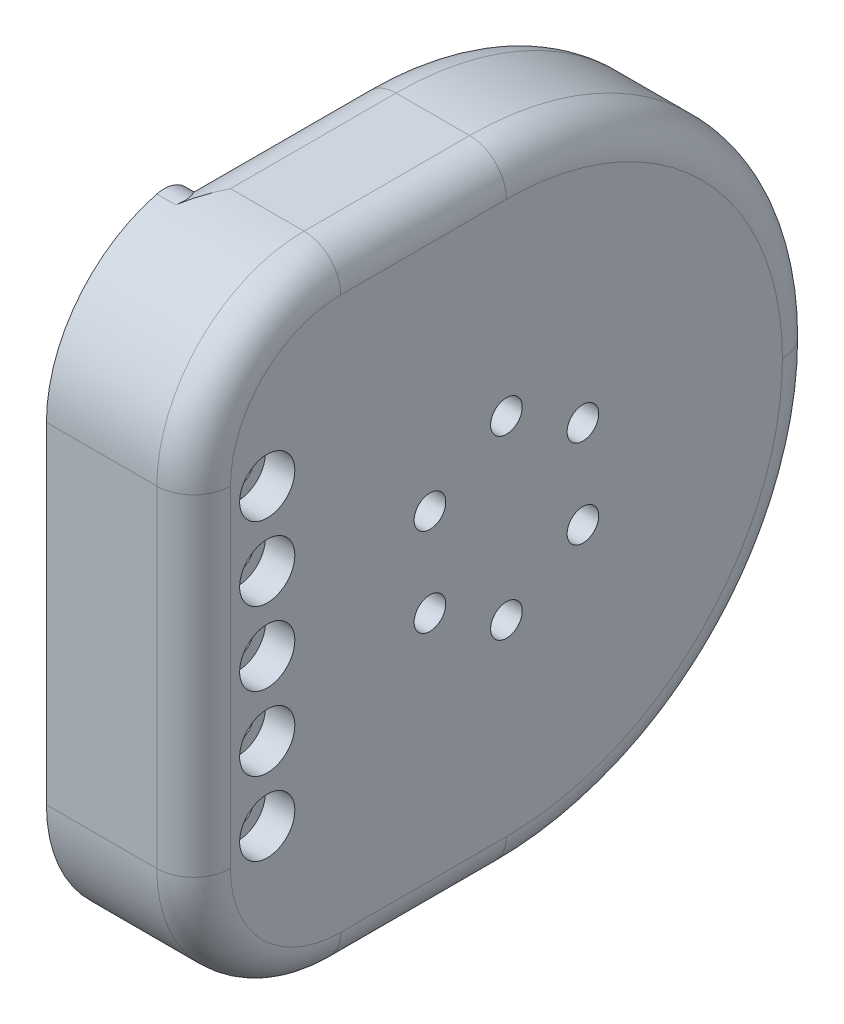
ISO-10303-21;
HEADER;
FILE_DESCRIPTION(('STEP AP214'),'2;1');
FILE_NAME('part.step','',(''),(''),'','','');
FILE_SCHEMA(('AUTOMOTIVE_DESIGN { 1 0 10303 214 1 1 1 1 }'));
ENDSEC;
DATA;
#1=APPLICATION_CONTEXT('core data for automotive mechanical design processes');
#2=APPLICATION_PROTOCOL_DEFINITION('international standard','automotive_design',2000,#1);
#3=PRODUCT_CONTEXT('',#1,'mechanical');
#4=PRODUCT('Part','Part','',(#3));
#5=PRODUCT_RELATED_PRODUCT_CATEGORY('part','',(#4));
#6=PRODUCT_DEFINITION_FORMATION('','',#4);
#7=PRODUCT_DEFINITION_CONTEXT('part definition',#1,'design');
#8=PRODUCT_DEFINITION('design','',#6,#7);
#9=PRODUCT_DEFINITION_SHAPE('','',#8);
#10=(LENGTH_UNIT() NAMED_UNIT(*) SI_UNIT(.MILLI.,.METRE.));
#11=(NAMED_UNIT(*) PLANE_ANGLE_UNIT() SI_UNIT($,.RADIAN.));
#12=(NAMED_UNIT(*) SI_UNIT($,.STERADIAN.) SOLID_ANGLE_UNIT());
#13=UNCERTAINTY_MEASURE_WITH_UNIT(LENGTH_MEASURE(1.E-05),#10,'distance_accuracy_value','');
#14=(GEOMETRIC_REPRESENTATION_CONTEXT(3) GLOBAL_UNCERTAINTY_ASSIGNED_CONTEXT((#13)) GLOBAL_UNIT_ASSIGNED_CONTEXT((#10,
#11,#12)) REPRESENTATION_CONTEXT('',''));
#15=CARTESIAN_POINT('',(0.,0.,0.));
#16=DIRECTION('',(0.,0.,1.));
#17=DIRECTION('',(1.,0.,0.));
#18=AXIS2_PLACEMENT_3D('',#15,#16,#17);
#19=CARTESIAN_POINT('',(46.,37.5,9.));
#20=DIRECTION('',(-1.,0.,0.));
#21=DIRECTION('',(0.,-1.,0.));
#22=AXIS2_PLACEMENT_3D('',#19,#20,#21);
#23=PLANE('',#22);
#24=CARTESIAN_POINT('',(46.,-20.,19.));
#25=DIRECTION('',(-1.,0.,0.));
#26=DIRECTION('',(0.,-1.,0.));
#27=AXIS2_PLACEMENT_3D('',#24,#25,#26);
#28=CIRCLE('',#27,2.15);
#29=CARTESIAN_POINT('',(46.,-20.,16.85));
#30=VERTEX_POINT('',#29);
#31=EDGE_CURVE('E217',#30,#30,#28,.F.);
#32=ORIENTED_EDGE('',*,*,#31,.T.);
#33=EDGE_LOOP('',(#32));
#34=FACE_BOUND('',#33,.T.);
#35=CARTESIAN_POINT('',(46.,20.,19.));
#36=DIRECTION('',(-1.,0.,0.));
#37=DIRECTION('',(0.,-1.,0.));
#38=AXIS2_PLACEMENT_3D('',#35,#36,#37);
#39=CIRCLE('',#38,2.15);
#40=CARTESIAN_POINT('',(46.,20.,16.85));
#41=VERTEX_POINT('',#40);
#42=EDGE_CURVE('E211',#41,#41,#39,.F.);
#43=ORIENTED_EDGE('',*,*,#42,.T.);
#44=EDGE_LOOP('',(#43));
#45=FACE_BOUND('',#44,.T.);
#46=CARTESIAN_POINT('',(46.,0.,19.));
#47=DIRECTION('',(-1.,0.,0.));
#48=DIRECTION('',(0.,-1.,0.));
#49=AXIS2_PLACEMENT_3D('',#46,#47,#48);
#50=CIRCLE('',#49,2.15);
#51=CARTESIAN_POINT('',(46.,0.,16.85));
#52=VERTEX_POINT('',#51);
#53=EDGE_CURVE('E205',#52,#52,#50,.F.);
#54=ORIENTED_EDGE('',*,*,#53,.T.);
#55=EDGE_LOOP('',(#54));
#56=FACE_BOUND('',#55,.T.);
#57=CARTESIAN_POINT('',(46.,10.,19.));
#58=DIRECTION('',(-1.,0.,0.));
#59=DIRECTION('',(0.,-1.,0.));
#60=AXIS2_PLACEMENT_3D('',#57,#58,#59);
#61=CIRCLE('',#60,2.15);
#62=CARTESIAN_POINT('',(46.,10.,16.85));
#63=VERTEX_POINT('',#62);
#64=EDGE_CURVE('E208',#63,#63,#61,.F.);
#65=ORIENTED_EDGE('',*,*,#64,.T.);
#66=EDGE_LOOP('',(#65));
#67=FACE_BOUND('',#66,.T.);
#68=CARTESIAN_POINT('',(46.,-10.,19.));
#69=DIRECTION('',(-1.,0.,0.));
#70=DIRECTION('',(0.,-1.,0.));
#71=AXIS2_PLACEMENT_3D('',#68,#69,#70);
#72=CIRCLE('',#71,2.15);
#73=CARTESIAN_POINT('',(46.,-10.,16.85));
#74=VERTEX_POINT('',#73);
#75=EDGE_CURVE('E214',#74,#74,#72,.F.);
#76=ORIENTED_EDGE('',*,*,#75,.T.);
#77=EDGE_LOOP('',(#76));
#78=FACE_BOUND('',#77,.T.);
#79=CARTESIAN_POINT('',(46.,-37.9919333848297,13.));
#80=DIRECTION('',(-1.,0.,0.));
#81=DIRECTION('',(0.,-1.,0.));
#82=AXIS2_PLACEMENT_3D('',#79,#80,#81);
#83=CIRCLE('',#82,4.);
#84=CARTESIAN_POINT('',(46.,-41.8649167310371,14.));
#85=VERTEX_POINT('',#84);
#86=CARTESIAN_POINT('',(46.,-37.9919333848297,9.));
#87=VERTEX_POINT('',#86);
#88=EDGE_CURVE('E224',#85,#87,#83,.F.);
#89=ORIENTED_EDGE('',*,*,#88,.F.);
#90=CARTESIAN_POINT('',(46.,-22.5,9.));
#91=DIRECTION('',(-1.,0.,0.));
#92=DIRECTION('',(0.,-1.,0.));
#93=AXIS2_PLACEMENT_3D('',#90,#91,#92);
#94=CIRCLE('',#93,20.);
#95=CARTESIAN_POINT('',(46.,-22.5,29.));
#96=VERTEX_POINT('',#95);
#97=EDGE_CURVE('E170',#96,#85,#94,.F.);
#98=ORIENTED_EDGE('',*,*,#97,.F.);
#99=DIRECTION('',(0.,-1.,0.));
#100=VECTOR('',#99,1.);
#101=CARTESIAN_POINT('',(46.,0.,29.));
#102=LINE('',#101,#100);
#103=CARTESIAN_POINT('',(46.,22.5,29.));
#104=VERTEX_POINT('',#103);
#105=EDGE_CURVE('E171',#104,#96,#102,.T.);
#106=ORIENTED_EDGE('',*,*,#105,.F.);
#107=CARTESIAN_POINT('',(46.,22.5,9.));
#108=DIRECTION('',(-1.,0.,0.));
#109=DIRECTION('',(0.,-1.,0.));
#110=AXIS2_PLACEMENT_3D('',#107,#108,#109);
#111=CIRCLE('',#110,20.);
#112=CARTESIAN_POINT('',(46.,41.8649167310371,14.));
#113=VERTEX_POINT('',#112);
#114=EDGE_CURVE('E160',#113,#104,#111,.F.);
#115=ORIENTED_EDGE('',*,*,#114,.F.);
#116=CARTESIAN_POINT('',(46.,37.9919333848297,13.));
#117=DIRECTION('',(-1.,0.,0.));
#118=DIRECTION('',(0.,-1.,0.));
#119=AXIS2_PLACEMENT_3D('',#116,#117,#118);
#120=CIRCLE('',#119,4.);
#121=CARTESIAN_POINT('',(46.,37.9919333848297,9.));
#122=VERTEX_POINT('',#121);
#123=EDGE_CURVE('E226',#122,#113,#120,.F.);
#124=ORIENTED_EDGE('',*,*,#123,.F.);
#125=DIRECTION('',(0.,-1.,0.));
#126=VECTOR('',#125,1.);
#127=CARTESIAN_POINT('',(46.,0.,9.));
#128=LINE('',#127,#126);
#129=CARTESIAN_POINT('',(46.,37.5,9.));
#130=VERTEX_POINT('',#129);
#131=EDGE_CURVE('E178',#122,#130,#128,.T.);
#132=ORIENTED_EDGE('',*,*,#131,.T.);
#133=DIRECTION('',(0.,0.,1.));
#134=VECTOR('',#133,1.);
#135=CARTESIAN_POINT('',(46.,37.5,-56.));
#136=LINE('',#135,#134);
#137=CARTESIAN_POINT('',(46.,37.5,-13.5));
#138=VERTEX_POINT('',#137);
#139=EDGE_CURVE('E374',#130,#138,#136,.F.);
#140=ORIENTED_EDGE('',*,*,#139,.T.);
#141=CARTESIAN_POINT('',(46.,0.,-13.5));
#142=DIRECTION('',(1.,0.,0.));
#143=DIRECTION('',(0.,1.,0.));
#144=AXIS2_PLACEMENT_3D('',#141,#142,#143);
#145=CIRCLE('',#144,37.5);
#146=CARTESIAN_POINT('',(46.,0.,-51.));
#147=VERTEX_POINT('',#146);
#148=EDGE_CURVE('E367',#138,#147,#145,.F.);
#149=ORIENTED_EDGE('',*,*,#148,.T.);
#150=CARTESIAN_POINT('',(46.,0.,-13.5));
#151=DIRECTION('',(1.,0.,0.));
#152=DIRECTION('',(0.,1.,0.));
#153=AXIS2_PLACEMENT_3D('',#150,#151,#152);
#154=CIRCLE('',#153,37.5);
#155=CARTESIAN_POINT('',(46.,-37.5,-13.5));
#156=VERTEX_POINT('',#155);
#157=EDGE_CURVE('E369',#147,#156,#154,.F.);
#158=ORIENTED_EDGE('',*,*,#157,.T.);
#159=DIRECTION('',(0.,0.,1.));
#160=VECTOR('',#159,1.);
#161=CARTESIAN_POINT('',(46.,-37.5,-56.));
#162=LINE('',#161,#160);
#163=CARTESIAN_POINT('',(46.,-37.5,9.));
#164=VERTEX_POINT('',#163);
#165=EDGE_CURVE('E371',#156,#164,#162,.T.);
#166=ORIENTED_EDGE('',*,*,#165,.T.);
#167=EDGE_CURVE('E220',#164,#87,#128,.T.);
#168=ORIENTED_EDGE('',*,*,#167,.T.);
#169=EDGE_LOOP('',(#89,#98,#106,#115,#124,#132,#140,#149,#158,#166,#168));
#170=FACE_BOUND('',#169,.T.);
#171=CARTESIAN_POINT('',(46.,-5.99999999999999,-3.10769515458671));
#172=DIRECTION('',(-1.,0.,0.));
#173=DIRECTION('',(0.,-1.,0.));
#174=AXIS2_PLACEMENT_3D('',#171,#172,#173);
#175=CIRCLE('',#174,3.75);
#176=CARTESIAN_POINT('',(46.,-9.74999999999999,-3.10769515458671));
#177=VERTEX_POINT('',#176);
#178=EDGE_CURVE('E264',#177,#177,#175,.T.);
#179=ORIENTED_EDGE('',*,*,#178,.F.);
#180=EDGE_LOOP('',(#179));
#181=FACE_BOUND('',#180,.T.);
#182=CARTESIAN_POINT('',(46.,-12.,-13.5));
#183=DIRECTION('',(-1.,0.,0.));
#184=DIRECTION('',(0.,-1.,0.));
#185=AXIS2_PLACEMENT_3D('',#182,#183,#184);
#186=CIRCLE('',#185,3.75);
#187=CARTESIAN_POINT('',(46.,-15.75,-13.5));
#188=VERTEX_POINT('',#187);
#189=EDGE_CURVE('E271',#188,#188,#186,.T.);
#190=ORIENTED_EDGE('',*,*,#189,.F.);
#191=EDGE_LOOP('',(#190));
#192=FACE_BOUND('',#191,.T.);
#193=CARTESIAN_POINT('',(46.,-5.99999999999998,-23.8923048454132));
#194=DIRECTION('',(-1.,0.,0.));
#195=DIRECTION('',(0.,-1.,0.));
#196=AXIS2_PLACEMENT_3D('',#193,#194,#195);
#197=CIRCLE('',#196,3.75);
#198=CARTESIAN_POINT('',(46.,-9.74999999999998,-23.8923048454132));
#199=VERTEX_POINT('',#198);
#200=EDGE_CURVE('E277',#199,#199,#197,.T.);
#201=ORIENTED_EDGE('',*,*,#200,.F.);
#202=EDGE_LOOP('',(#201));
#203=FACE_BOUND('',#202,.T.);
#204=CARTESIAN_POINT('',(46.,6.00000000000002,-23.8923048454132));
#205=DIRECTION('',(-1.,0.,0.));
#206=DIRECTION('',(0.,-1.,0.));
#207=AXIS2_PLACEMENT_3D('',#204,#205,#206);
#208=CIRCLE('',#207,3.75);
#209=CARTESIAN_POINT('',(46.,2.25000000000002,-23.8923048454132));
#210=VERTEX_POINT('',#209);
#211=EDGE_CURVE('E283',#210,#210,#208,.T.);
#212=ORIENTED_EDGE('',*,*,#211,.F.);
#213=EDGE_LOOP('',(#212));
#214=FACE_BOUND('',#213,.T.);
#215=CARTESIAN_POINT('',(46.,12.,-13.5));
#216=DIRECTION('',(-1.,0.,0.));
#217=DIRECTION('',(0.,-1.,0.));
#218=AXIS2_PLACEMENT_3D('',#215,#216,#217);
#219=CIRCLE('',#218,3.75);
#220=CARTESIAN_POINT('',(46.,8.25000000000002,-13.5));
#221=VERTEX_POINT('',#220);
#222=EDGE_CURVE('E256',#221,#221,#219,.T.);
#223=ORIENTED_EDGE('',*,*,#222,.F.);
#224=EDGE_LOOP('',(#223));
#225=FACE_BOUND('',#224,.T.);
#226=CARTESIAN_POINT('',(46.,6.00000000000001,-3.1076951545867));
#227=DIRECTION('',(-1.,0.,0.));
#228=DIRECTION('',(0.,-1.,0.));
#229=AXIS2_PLACEMENT_3D('',#226,#227,#228);
#230=CIRCLE('',#229,3.75);
#231=CARTESIAN_POINT('',(46.,2.25000000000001,-3.1076951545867));
#232=VERTEX_POINT('',#231);
#233=EDGE_CURVE('E268',#232,#232,#230,.T.);
#234=ORIENTED_EDGE('',*,*,#233,.F.);
#235=EDGE_LOOP('',(#234));
#236=FACE_BOUND('',#235,.T.);
#237=ADVANCED_FACE('F37',(#34,#45,#56,#67,#78,#170,#181,#192,#203,#214,#225,#236),#23,.T.);
#238=CARTESIAN_POINT('',(66.,42.5,29.));
#239=DIRECTION('',(1.,0.,0.));
#240=DIRECTION('',(0.,0.,-1.));
#241=AXIS2_PLACEMENT_3D('',#238,#239,#240);
#242=PLANE('',#241);
#243=CARTESIAN_POINT('',(66.,20.,19.));
#244=DIRECTION('',(1.,0.,0.));
#245=DIRECTION('',(0.,0.,-1.));
#246=AXIS2_PLACEMENT_3D('',#243,#244,#245);
#247=CIRCLE('',#246,3.75);
#248=CARTESIAN_POINT('',(66.,20.,15.25));
#249=VERTEX_POINT('',#248);
#250=EDGE_CURVE('E232',#249,#249,#247,.T.);
#251=ORIENTED_EDGE('',*,*,#250,.F.);
#252=EDGE_LOOP('',(#251));
#253=FACE_BOUND('',#252,.T.);
#254=CARTESIAN_POINT('',(66.,10.,19.));
#255=DIRECTION('',(1.,0.,0.));
#256=DIRECTION('',(0.,0.,-1.));
#257=AXIS2_PLACEMENT_3D('',#254,#255,#256);
#258=CIRCLE('',#257,3.75);
#259=CARTESIAN_POINT('',(66.,10.,15.25));
#260=VERTEX_POINT('',#259);
#261=EDGE_CURVE('E236',#260,#260,#258,.T.);
#262=ORIENTED_EDGE('',*,*,#261,.F.);
#263=EDGE_LOOP('',(#262));
#264=FACE_BOUND('',#263,.T.);
#265=CARTESIAN_POINT('',(66.,0.,19.));
#266=DIRECTION('',(1.,0.,0.));
#267=DIRECTION('',(0.,0.,-1.));
#268=AXIS2_PLACEMENT_3D('',#265,#266,#267);
#269=CIRCLE('',#268,3.75);
#270=CARTESIAN_POINT('',(66.,0.,15.25));
#271=VERTEX_POINT('',#270);
#272=EDGE_CURVE('E242',#271,#271,#269,.T.);
#273=ORIENTED_EDGE('',*,*,#272,.F.);
#274=EDGE_LOOP('',(#273));
#275=FACE_BOUND('',#274,.T.);
#276=CARTESIAN_POINT('',(66.,-10.,19.));
#277=DIRECTION('',(1.,0.,0.));
#278=DIRECTION('',(0.,0.,-1.));
#279=AXIS2_PLACEMENT_3D('',#276,#277,#278);
#280=CIRCLE('',#279,3.75);
#281=CARTESIAN_POINT('',(66.,-10.,15.25));
#282=VERTEX_POINT('',#281);
#283=EDGE_CURVE('E248',#282,#282,#280,.T.);
#284=ORIENTED_EDGE('',*,*,#283,.F.);
#285=EDGE_LOOP('',(#284));
#286=FACE_BOUND('',#285,.T.);
#287=CARTESIAN_POINT('',(66.,-20.,19.));
#288=DIRECTION('',(1.,0.,0.));
#289=DIRECTION('',(0.,0.,-1.));
#290=AXIS2_PLACEMENT_3D('',#287,#288,#289);
#291=CIRCLE('',#290,3.75);
#292=CARTESIAN_POINT('',(66.,-20.,15.25));
#293=VERTEX_POINT('',#292);
#294=EDGE_CURVE('E47',#293,#293,#291,.T.);
#295=ORIENTED_EDGE('',*,*,#294,.F.);
#296=EDGE_LOOP('',(#295));
#297=FACE_BOUND('',#296,.T.);
#298=DIRECTION('',(0.,0.,-1.));
#299=VECTOR('',#298,1.);
#300=CARTESIAN_POINT('',(66.,37.5,9.));
#301=LINE('',#300,#299);
#302=CARTESIAN_POINT('',(66.,37.5,-13.5));
#303=VERTEX_POINT('',#302);
#304=CARTESIAN_POINT('',(66.,37.5,9.));
#305=VERTEX_POINT('',#304);
#306=EDGE_CURVE('E60',#303,#305,#301,.F.);
#307=ORIENTED_EDGE('',*,*,#306,.T.);
#308=CARTESIAN_POINT('',(66.,22.5,9.));
#309=DIRECTION('',(1.,0.,0.));
#310=DIRECTION('',(0.,0.,-1.));
#311=AXIS2_PLACEMENT_3D('',#308,#309,#310);
#312=CIRCLE('',#311,15.);
#313=CARTESIAN_POINT('',(66.,22.5,24.));
#314=VERTEX_POINT('',#313);
#315=EDGE_CURVE('E327',#305,#314,#312,.T.);
#316=ORIENTED_EDGE('',*,*,#315,.T.);
#317=DIRECTION('',(0.,-1.,0.));
#318=VECTOR('',#317,1.);
#319=CARTESIAN_POINT('',(66.,42.5,24.));
#320=LINE('',#319,#318);
#321=CARTESIAN_POINT('',(66.,-22.5,24.));
#322=VERTEX_POINT('',#321);
#323=EDGE_CURVE('E325',#314,#322,#320,.T.);
#324=ORIENTED_EDGE('',*,*,#323,.T.);
#325=CARTESIAN_POINT('',(66.,-22.5,9.));
#326=DIRECTION('',(1.,0.,0.));
#327=DIRECTION('',(0.,0.,-1.));
#328=AXIS2_PLACEMENT_3D('',#325,#326,#327);
#329=CIRCLE('',#328,15.);
#330=CARTESIAN_POINT('',(66.,-37.5,9.));
#331=VERTEX_POINT('',#330);
#332=EDGE_CURVE('E323',#322,#331,#329,.T.);
#333=ORIENTED_EDGE('',*,*,#332,.T.);
#334=DIRECTION('',(0.,0.,-1.));
#335=VECTOR('',#334,1.);
#336=CARTESIAN_POINT('',(66.,-37.5,-13.5));
#337=LINE('',#336,#335);
#338=CARTESIAN_POINT('',(66.,-37.5,-13.5));
#339=VERTEX_POINT('',#338);
#340=EDGE_CURVE('E321',#331,#339,#337,.T.);
#341=ORIENTED_EDGE('',*,*,#340,.T.);
#342=CARTESIAN_POINT('',(66.,0.,-13.5));
#343=DIRECTION('',(1.,0.,0.));
#344=DIRECTION('',(0.,0.,-1.));
#345=AXIS2_PLACEMENT_3D('',#342,#343,#344);
#346=CIRCLE('',#345,37.5);
#347=CARTESIAN_POINT('',(66.,0.,-51.));
#348=VERTEX_POINT('',#347);
#349=EDGE_CURVE('E319',#339,#348,#346,.T.);
#350=ORIENTED_EDGE('',*,*,#349,.T.);
#351=CARTESIAN_POINT('',(66.,0.,-13.5));
#352=DIRECTION('',(1.,0.,0.));
#353=DIRECTION('',(0.,0.,-1.));
#354=AXIS2_PLACEMENT_3D('',#351,#352,#353);
#355=CIRCLE('',#354,37.5);
#356=EDGE_CURVE('E55',#348,#303,#355,.T.);
#357=ORIENTED_EDGE('',*,*,#356,.T.);
#358=EDGE_LOOP('',(#307,#316,#324,#333,#341,#350,#357));
#359=FACE_BOUND('',#358,.T.);
#360=CARTESIAN_POINT('',(66.,12.,-13.5));
#361=DIRECTION('',(1.,0.,0.));
#362=DIRECTION('',(0.,0.,-1.));
#363=AXIS2_PLACEMENT_3D('',#360,#361,#362);
#364=CIRCLE('',#363,2.15);
#365=CARTESIAN_POINT('',(66.,12.,-15.65));
#366=VERTEX_POINT('',#365);
#367=EDGE_CURVE('E183',#366,#366,#364,.T.);
#368=ORIENTED_EDGE('',*,*,#367,.F.);
#369=EDGE_LOOP('',(#368));
#370=FACE_BOUND('',#369,.T.);
#371=CARTESIAN_POINT('',(66.,6.00000000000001,-3.1076951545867));
#372=DIRECTION('',(1.,0.,0.));
#373=DIRECTION('',(0.,0.,-1.));
#374=AXIS2_PLACEMENT_3D('',#371,#372,#373);
#375=CIRCLE('',#374,2.15);
#376=CARTESIAN_POINT('',(66.,6.00000000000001,-5.2576951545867));
#377=VERTEX_POINT('',#376);
#378=EDGE_CURVE('E294',#377,#377,#375,.T.);
#379=ORIENTED_EDGE('',*,*,#378,.F.);
#380=EDGE_LOOP('',(#379));
#381=FACE_BOUND('',#380,.T.);
#382=CARTESIAN_POINT('',(66.,-5.99999999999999,-3.10769515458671));
#383=DIRECTION('',(1.,0.,0.));
#384=DIRECTION('',(0.,0.,-1.));
#385=AXIS2_PLACEMENT_3D('',#382,#383,#384);
#386=CIRCLE('',#385,2.15);
#387=CARTESIAN_POINT('',(66.,-5.99999999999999,-5.25769515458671));
#388=VERTEX_POINT('',#387);
#389=EDGE_CURVE('E298',#388,#388,#386,.T.);
#390=ORIENTED_EDGE('',*,*,#389,.F.);
#391=EDGE_LOOP('',(#390));
#392=FACE_BOUND('',#391,.T.);
#393=CARTESIAN_POINT('',(66.,-12.,-13.5));
#394=DIRECTION('',(1.,0.,0.));
#395=DIRECTION('',(0.,0.,-1.));
#396=AXIS2_PLACEMENT_3D('',#393,#394,#395);
#397=CIRCLE('',#396,2.15);
#398=CARTESIAN_POINT('',(66.,-12.,-15.65));
#399=VERTEX_POINT('',#398);
#400=EDGE_CURVE('E304',#399,#399,#397,.T.);
#401=ORIENTED_EDGE('',*,*,#400,.F.);
#402=EDGE_LOOP('',(#401));
#403=FACE_BOUND('',#402,.T.);
#404=CARTESIAN_POINT('',(66.,-5.99999999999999,-23.8923048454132));
#405=DIRECTION('',(1.,0.,0.));
#406=DIRECTION('',(0.,0.,-1.));
#407=AXIS2_PLACEMENT_3D('',#404,#405,#406);
#408=CIRCLE('',#407,2.15);
#409=CARTESIAN_POINT('',(66.,-5.99999999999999,-26.0423048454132));
#410=VERTEX_POINT('',#409);
#411=EDGE_CURVE('E301',#410,#410,#408,.T.);
#412=ORIENTED_EDGE('',*,*,#411,.F.);
#413=EDGE_LOOP('',(#412));
#414=FACE_BOUND('',#413,.T.);
#415=CARTESIAN_POINT('',(66.,6.00000000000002,-23.8923048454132));
#416=DIRECTION('',(1.,0.,0.));
#417=DIRECTION('',(0.,0.,-1.));
#418=AXIS2_PLACEMENT_3D('',#415,#416,#417);
#419=CIRCLE('',#418,2.15);
#420=CARTESIAN_POINT('',(66.,6.00000000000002,-26.0423048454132));
#421=VERTEX_POINT('',#420);
#422=EDGE_CURVE('E186',#421,#421,#419,.T.);
#423=ORIENTED_EDGE('',*,*,#422,.F.);
#424=EDGE_LOOP('',(#423));
#425=FACE_BOUND('',#424,.T.);
#426=ADVANCED_FACE('F468',(#253,#264,#275,#286,#297,#359,#370,#381,#392,#403,#414,#425),#242,.T.);
#427=CARTESIAN_POINT('',(61.,-37.5,29.));
#428=DIRECTION('',(0.,0.,1.));
#429=DIRECTION('',(1.,0.,0.));
#430=AXIS2_PLACEMENT_3D('',#427,#428,#429);
#431=CYLINDRICAL_SURFACE('',#430,5.);
#432=CARTESIAN_POINT('',(61.,-37.5,-13.5));
#433=DIRECTION('',(0.,0.,1.));
#434=DIRECTION('',(1.,0.,0.));
#435=AXIS2_PLACEMENT_3D('',#432,#433,#434);
#436=CIRCLE('',#435,5.);
#437=CARTESIAN_POINT('',(61.,-42.5,-13.5));
#438=VERTEX_POINT('',#437);
#439=EDGE_CURVE('E316',#438,#339,#436,.T.);
#440=ORIENTED_EDGE('',*,*,#439,.T.);
#441=ORIENTED_EDGE('',*,*,#340,.F.);
#442=CARTESIAN_POINT('',(61.,-37.5,9.));
#443=DIRECTION('',(0.,0.,1.));
#444=DIRECTION('',(1.,0.,0.));
#445=AXIS2_PLACEMENT_3D('',#442,#443,#444);
#446=CIRCLE('',#445,5.);
#447=CARTESIAN_POINT('',(61.,-42.5,9.));
#448=VERTEX_POINT('',#447);
#449=EDGE_CURVE('E357',#448,#331,#446,.T.);
#450=ORIENTED_EDGE('',*,*,#449,.F.);
#451=DIRECTION('',(0.,0.,-1.));
#452=VECTOR('',#451,1.);
#453=CARTESIAN_POINT('',(61.,-42.5,9.));
#454=LINE('',#453,#452);
#455=EDGE_CURVE('E334',#438,#448,#454,.F.);
#456=ORIENTED_EDGE('',*,*,#455,.F.);
#457=EDGE_LOOP('',(#440,#441,#450,#456));
#458=FACE_BOUND('',#457,.T.);
#459=ADVANCED_FACE('F464',(#458),#431,.T.);
#460=CARTESIAN_POINT('',(61.,0.,-13.5));
#461=DIRECTION('',(1.,0.,0.));
#462=DIRECTION('',(0.,0.,-1.));
#463=AXIS2_PLACEMENT_3D('',#460,#461,#462);
#464=TOROIDAL_SURFACE('',#463,37.5,5.);
#465=CARTESIAN_POINT('',(61.,0.,-51.));
#466=DIRECTION('',(0.,1.,0.));
#467=DIRECTION('',(0.,0.,1.));
#468=AXIS2_PLACEMENT_3D('',#465,#466,#467);
#469=CIRCLE('',#468,5.);
#470=CARTESIAN_POINT('',(61.,0.,-56.));
#471=VERTEX_POINT('',#470);
#472=EDGE_CURVE('E360',#348,#471,#469,.T.);
#473=ORIENTED_EDGE('',*,*,#472,.F.);
#474=ORIENTED_EDGE('',*,*,#349,.F.);
#475=ORIENTED_EDGE('',*,*,#439,.F.);
#476=CARTESIAN_POINT('',(61.,0.,-13.5));
#477=DIRECTION('',(1.,0.,0.));
#478=DIRECTION('',(0.,0.,-1.));
#479=AXIS2_PLACEMENT_3D('',#476,#477,#478);
#480=CIRCLE('',#479,42.5);
#481=EDGE_CURVE('E336',#471,#438,#480,.F.);
#482=ORIENTED_EDGE('',*,*,#481,.F.);
#483=EDGE_LOOP('',(#473,#474,#475,#482));
#484=FACE_BOUND('',#483,.T.);
#485=ADVANCED_FACE('F459',(#484),#464,.T.);
#486=CARTESIAN_POINT('',(61.,0.,-13.5));
#487=DIRECTION('',(1.,0.,0.));
#488=DIRECTION('',(0.,0.,-1.));
#489=AXIS2_PLACEMENT_3D('',#486,#487,#488);
#490=TOROIDAL_SURFACE('',#489,37.5,5.);
#491=ORIENTED_EDGE('',*,*,#472,.T.);
#492=CARTESIAN_POINT('',(61.,0.,-13.5));
#493=DIRECTION('',(1.,0.,0.));
#494=DIRECTION('',(0.,0.,-1.));
#495=AXIS2_PLACEMENT_3D('',#492,#493,#494);
#496=CIRCLE('',#495,42.5);
#497=CARTESIAN_POINT('',(61.,42.5,-13.5));
#498=VERTEX_POINT('',#497);
#499=EDGE_CURVE('E339',#498,#471,#496,.F.);
#500=ORIENTED_EDGE('',*,*,#499,.F.);
#501=CARTESIAN_POINT('',(61.,37.5,-13.5));
#502=DIRECTION('',(0.,0.,1.));
#503=DIRECTION('',(1.,0.,0.));
#504=AXIS2_PLACEMENT_3D('',#501,#502,#503);
#505=CIRCLE('',#504,5.);
#506=EDGE_CURVE('E354',#303,#498,#505,.T.);
#507=ORIENTED_EDGE('',*,*,#506,.F.);
#508=ORIENTED_EDGE('',*,*,#356,.F.);
#509=EDGE_LOOP('',(#491,#500,#507,#508));
#510=FACE_BOUND('',#509,.T.);
#511=ADVANCED_FACE('F463',(#510),#490,.T.);
#512=CARTESIAN_POINT('',(61.,37.5,29.));
#513=DIRECTION('',(0.,0.,1.));
#514=DIRECTION('',(1.,0.,0.));
#515=AXIS2_PLACEMENT_3D('',#512,#513,#514);
#516=CYLINDRICAL_SURFACE('',#515,5.);
#517=ORIENTED_EDGE('',*,*,#506,.T.);
#518=DIRECTION('',(0.,0.,-1.));
#519=VECTOR('',#518,1.);
#520=CARTESIAN_POINT('',(61.,42.5,-13.5));
#521=LINE('',#520,#519);
#522=CARTESIAN_POINT('',(61.,42.5,9.));
#523=VERTEX_POINT('',#522);
#524=EDGE_CURVE('E342',#523,#498,#521,.T.);
#525=ORIENTED_EDGE('',*,*,#524,.F.);
#526=CARTESIAN_POINT('',(61.,37.5,9.));
#527=DIRECTION('',(0.,0.,1.));
#528=DIRECTION('',(1.,0.,0.));
#529=AXIS2_PLACEMENT_3D('',#526,#527,#528);
#530=CIRCLE('',#529,5.);
#531=EDGE_CURVE('E348',#305,#523,#530,.T.);
#532=ORIENTED_EDGE('',*,*,#531,.F.);
#533=ORIENTED_EDGE('',*,*,#306,.F.);
#534=EDGE_LOOP('',(#517,#525,#532,#533));
#535=FACE_BOUND('',#534,.T.);
#536=ADVANCED_FACE('F472',(#535),#516,.T.);
#537=CARTESIAN_POINT('',(61.,42.5,24.));
#538=DIRECTION('',(0.,-1.,0.));
#539=DIRECTION('',(0.,0.,-1.));
#540=AXIS2_PLACEMENT_3D('',#537,#538,#539);
#541=CYLINDRICAL_SURFACE('',#540,5.);
#542=CARTESIAN_POINT('',(61.,-22.5,24.));
#543=DIRECTION('',(0.,1.,0.));
#544=DIRECTION('',(0.,0.,1.));
#545=AXIS2_PLACEMENT_3D('',#542,#543,#544);
#546=CIRCLE('',#545,5.);
#547=CARTESIAN_POINT('',(61.,-22.5,29.));
#548=VERTEX_POINT('',#547);
#549=EDGE_CURVE('E351',#548,#322,#546,.T.);
#550=ORIENTED_EDGE('',*,*,#549,.T.);
#551=ORIENTED_EDGE('',*,*,#323,.F.);
#552=CARTESIAN_POINT('',(61.,22.5,24.));
#553=DIRECTION('',(0.,1.,0.));
#554=DIRECTION('',(0.,0.,1.));
#555=AXIS2_PLACEMENT_3D('',#552,#553,#554);
#556=CIRCLE('',#555,5.);
#557=CARTESIAN_POINT('',(61.,22.5,29.));
#558=VERTEX_POINT('',#557);
#559=EDGE_CURVE('E345',#558,#314,#556,.T.);
#560=ORIENTED_EDGE('',*,*,#559,.F.);
#561=DIRECTION('',(0.,-1.,0.));
#562=VECTOR('',#561,1.);
#563=CARTESIAN_POINT('',(61.,0.,29.));
#564=LINE('',#563,#562);
#565=EDGE_CURVE('E182',#548,#558,#564,.F.);
#566=ORIENTED_EDGE('',*,*,#565,.F.);
#567=EDGE_LOOP('',(#550,#551,#560,#566));
#568=FACE_BOUND('',#567,.T.);
#569=ADVANCED_FACE('F481',(#568),#541,.T.);
#570=CARTESIAN_POINT('',(61.,22.5,9.));
#571=DIRECTION('',(1.,0.,0.));
#572=DIRECTION('',(0.,0.,-1.));
#573=AXIS2_PLACEMENT_3D('',#570,#571,#572);
#574=TOROIDAL_SURFACE('',#573,15.,5.);
#575=ORIENTED_EDGE('',*,*,#531,.T.);
#576=CARTESIAN_POINT('',(61.,22.5,9.));
#577=DIRECTION('',(1.,0.,0.));
#578=DIRECTION('',(0.,0.,-1.));
#579=AXIS2_PLACEMENT_3D('',#576,#577,#578);
#580=CIRCLE('',#579,20.);
#581=EDGE_CURVE('E329',#558,#523,#580,.F.);
#582=ORIENTED_EDGE('',*,*,#581,.F.);
#583=ORIENTED_EDGE('',*,*,#559,.T.);
#584=ORIENTED_EDGE('',*,*,#315,.F.);
#585=EDGE_LOOP('',(#575,#582,#583,#584));
#586=FACE_BOUND('',#585,.T.);
#587=ADVANCED_FACE('F477',(#586),#574,.T.);
#588=CARTESIAN_POINT('',(61.,-22.5,9.));
#589=DIRECTION('',(1.,0.,0.));
#590=DIRECTION('',(0.,0.,-1.));
#591=AXIS2_PLACEMENT_3D('',#588,#589,#590);
#592=TOROIDAL_SURFACE('',#591,15.,5.);
#593=ORIENTED_EDGE('',*,*,#449,.T.);
#594=ORIENTED_EDGE('',*,*,#332,.F.);
#595=ORIENTED_EDGE('',*,*,#549,.F.);
#596=CARTESIAN_POINT('',(61.,-22.5,9.));
#597=DIRECTION('',(1.,0.,0.));
#598=DIRECTION('',(0.,0.,-1.));
#599=AXIS2_PLACEMENT_3D('',#596,#597,#598);
#600=CIRCLE('',#599,20.);
#601=EDGE_CURVE('E332',#448,#548,#600,.F.);
#602=ORIENTED_EDGE('',*,*,#601,.F.);
#603=EDGE_LOOP('',(#593,#594,#595,#602));
#604=FACE_BOUND('',#603,.T.);
#605=ADVANCED_FACE('F474',(#604),#592,.T.);
#606=CARTESIAN_POINT('',(0.,0.,29.));
#607=DIRECTION('',(0.,0.,1.));
#608=DIRECTION('',(1.,0.,0.));
#609=AXIS2_PLACEMENT_3D('',#606,#607,#608);
#610=PLANE('',#609);
#611=DIRECTION('',(-1.,0.,0.));
#612=VECTOR('',#611,1.);
#613=CARTESIAN_POINT('',(0.,22.5,29.));
#614=LINE('',#613,#612);
#615=EDGE_CURVE('E42',#558,#104,#614,.T.);
#616=ORIENTED_EDGE('',*,*,#615,.T.);
#617=ORIENTED_EDGE('',*,*,#105,.T.);
#618=DIRECTION('',(1.,0.,0.));
#619=VECTOR('',#618,1.);
#620=CARTESIAN_POINT('',(66.,-22.5,29.));
#621=LINE('',#620,#619);
#622=EDGE_CURVE('E184',#96,#548,#621,.T.);
#623=ORIENTED_EDGE('',*,*,#622,.T.);
#624=ORIENTED_EDGE('',*,*,#565,.T.);
#625=EDGE_LOOP('',(#616,#617,#623,#624));
#626=FACE_BOUND('',#625,.T.);
#627=ADVANCED_FACE('F180',(#626),#610,.T.);
#628=CARTESIAN_POINT('',(0.,-42.5,29.));
#629=DIRECTION('',(0.,1.,0.));
#630=DIRECTION('',(0.,0.,1.));
#631=AXIS2_PLACEMENT_3D('',#628,#629,#630);
#632=PLANE('',#631);
#633=DIRECTION('',(1.,0.,0.));
#634=VECTOR('',#633,1.);
#635=CARTESIAN_POINT('',(0.,-42.5,9.));
#636=LINE('',#635,#634);
#637=CARTESIAN_POINT('',(51.,-42.5,9.));
#638=VERTEX_POINT('',#637);
#639=EDGE_CURVE('E188',#448,#638,#636,.F.);
#640=ORIENTED_EDGE('',*,*,#639,.T.);
#641=DIRECTION('',(0.,0.,1.));
#642=VECTOR('',#641,1.);
#643=CARTESIAN_POINT('',(51.,-42.5,29.));
#644=LINE('',#643,#642);
#645=CARTESIAN_POINT('',(51.,-42.5,-13.5));
#646=VERTEX_POINT('',#645);
#647=EDGE_CURVE('E376',#638,#646,#644,.F.);
#648=ORIENTED_EDGE('',*,*,#647,.T.);
#649=DIRECTION('',(-1.,0.,0.));
#650=VECTOR('',#649,1.);
#651=CARTESIAN_POINT('',(66.,-42.5,-13.5));
#652=LINE('',#651,#650);
#653=EDGE_CURVE('E310',#646,#438,#652,.F.);
#654=ORIENTED_EDGE('',*,*,#653,.T.);
#655=ORIENTED_EDGE('',*,*,#455,.T.);
#656=EDGE_LOOP('',(#640,#648,#654,#655));
#657=FACE_BOUND('',#656,.T.);
#658=ADVANCED_FACE('F495',(#657),#632,.F.);
#659=CARTESIAN_POINT('',(0.,0.,-13.5));
#660=DIRECTION('',(1.,0.,0.));
#661=DIRECTION('',(0.,0.,-1.));
#662=AXIS2_PLACEMENT_3D('',#659,#660,#661);
#663=CYLINDRICAL_SURFACE('',#662,42.5);
#664=ORIENTED_EDGE('',*,*,#653,.F.);
#665=CARTESIAN_POINT('',(51.,0.,-13.5));
#666=DIRECTION('',(1.,0.,0.));
#667=DIRECTION('',(0.,1.,0.));
#668=AXIS2_PLACEMENT_3D('',#665,#666,#667);
#669=CIRCLE('',#668,42.5);
#670=CARTESIAN_POINT('',(51.,0.,-56.));
#671=VERTEX_POINT('',#670);
#672=EDGE_CURVE('E378',#646,#671,#669,.T.);
#673=ORIENTED_EDGE('',*,*,#672,.T.);
#674=DIRECTION('',(1.,0.,0.));
#675=VECTOR('',#674,1.);
#676=CARTESIAN_POINT('',(66.,0.,-56.));
#677=LINE('',#676,#675);
#678=EDGE_CURVE('E297',#671,#471,#677,.T.);
#679=ORIENTED_EDGE('',*,*,#678,.T.);
#680=ORIENTED_EDGE('',*,*,#481,.T.);
#681=EDGE_LOOP('',(#664,#673,#679,#680));
#682=FACE_BOUND('',#681,.T.);
#683=ADVANCED_FACE('F434',(#682),#663,.T.);
#684=CARTESIAN_POINT('',(51.,-37.5,-56.));
#685=DIRECTION('',(0.,0.,1.));
#686=DIRECTION('',(1.,0.,0.));
#687=AXIS2_PLACEMENT_3D('',#684,#685,#686);
#688=CYLINDRICAL_SURFACE('',#687,5.);
#689=CARTESIAN_POINT('',(51.,-37.5,9.));
#690=DIRECTION('',(0.,0.,1.));
#691=DIRECTION('',(1.,0.,0.));
#692=AXIS2_PLACEMENT_3D('',#689,#690,#691);
#693=CIRCLE('',#692,5.);
#694=CARTESIAN_POINT('',(46.0242586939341,-37.9919333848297,9.));
#695=VERTEX_POINT('',#694);
#696=EDGE_CURVE('E385',#164,#695,#693,.T.);
#697=ORIENTED_EDGE('',*,*,#696,.F.);
#698=ORIENTED_EDGE('',*,*,#165,.F.);
#699=CARTESIAN_POINT('',(51.,-37.5,-13.5));
#700=DIRECTION('',(0.,0.,-1.));
#701=DIRECTION('',(-1.,0.,0.));
#702=AXIS2_PLACEMENT_3D('',#699,#700,#701);
#703=CIRCLE('',#702,5.);
#704=EDGE_CURVE('E347',#646,#156,#703,.T.);
#705=ORIENTED_EDGE('',*,*,#704,.F.);
#706=ORIENTED_EDGE('',*,*,#647,.F.);
#707=CARTESIAN_POINT('',(48.5612499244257,-41.8649167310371,14.));
#708=CARTESIAN_POINT('',(48.6565818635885,-41.9181760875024,13.7937180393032));
#709=CARTESIAN_POINT('',(48.7530955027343,-41.9680063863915,13.5871189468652));
#710=CARTESIAN_POINT('',(48.9481573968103,-42.0608791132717,13.1733660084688));
#711=CARTESIAN_POINT('',(49.0467055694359,-42.1039218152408,12.9662121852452));
#712=CARTESIAN_POINT('',(49.344935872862,-42.2229860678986,12.3439806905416));
#713=CARTESIAN_POINT('',(49.5471889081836,-42.2889355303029,11.9281649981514));
#714=CARTESIAN_POINT('',(49.9547399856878,-42.3940207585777,11.0980648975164));
#715=CARTESIAN_POINT('',(50.160010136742,-42.4333259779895,10.6837878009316));
#716=CARTESIAN_POINT('',(50.5726461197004,-42.4860409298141,9.85474439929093));
#717=CARTESIAN_POINT('',(50.7800112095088,-42.4994595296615,9.43997831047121));
#718=CARTESIAN_POINT('',(50.9915672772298,-42.4999946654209,9.01686544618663));
#719=CARTESIAN_POINT('',(50.9957836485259,-42.4999999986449,9.0084327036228));
#720=CARTESIAN_POINT('',(51.,-42.5,9.));
#721=B_SPLINE_CURVE_WITH_KNOTS('',3,(#707,#708,#709,#710,#711,#712,#713,#714,#715,#716,#717,
#718,#719,#720),.UNSPECIFIED.,.F.,.F.,(4,2,2,2,2,2,4),(0.,0.700144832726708,1.40026139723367,
2.80060307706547,4.19195306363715,5.58282636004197,5.6111106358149),.UNSPECIFIED.);
#722=CARTESIAN_POINT('',(48.5612499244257,-41.8649167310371,14.));
#723=VERTEX_POINT('',#722);
#724=EDGE_CURVE('E196',#723,#638,#721,.T.);
#725=ORIENTED_EDGE('',*,*,#724,.F.);
#726=CARTESIAN_POINT('',(48.5612499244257,-41.8649167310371,14.));
#727=CARTESIAN_POINT('',(48.5868421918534,-41.8792202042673,13.9445693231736));
#728=CARTESIAN_POINT('',(48.611133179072,-41.8924921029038,13.888275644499));
#729=CARTESIAN_POINT('',(48.6564339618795,-41.9168256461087,13.7737463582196));
#730=CARTESIAN_POINT('',(48.6774348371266,-41.9278813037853,13.7155059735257));
#731=CARTESIAN_POINT('',(48.7343650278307,-41.9574384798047,13.5377284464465));
#732=CARTESIAN_POINT('',(48.7641016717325,-41.9722650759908,13.4153803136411));
#733=CARTESIAN_POINT('',(48.7974116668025,-41.9887528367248,13.1892560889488));
#734=CARTESIAN_POINT('',(48.804784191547,-41.9923303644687,13.0861909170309));
#735=CARTESIAN_POINT('',(48.8030215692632,-41.9914678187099,12.88067936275));
#736=CARTESIAN_POINT('',(48.7939573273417,-41.987062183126,12.7782322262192));
#737=CARTESIAN_POINT('',(48.7571246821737,-41.9687817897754,12.5523120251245));
#738=CARTESIAN_POINT('',(48.7254006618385,-41.9528939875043,12.4296716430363));
#739=CARTESIAN_POINT('',(48.645579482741,-41.9112007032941,12.1911947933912));
#740=CARTESIAN_POINT('',(48.5973884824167,-41.8853382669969,12.0754018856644));
#741=CARTESIAN_POINT('',(48.4962816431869,-41.8283271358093,11.8629570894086));
#742=CARTESIAN_POINT('',(48.4443917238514,-41.7980175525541,11.7655714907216));
#743=CARTESIAN_POINT('',(48.3352638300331,-41.7312264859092,11.5759925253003));
#744=CARTESIAN_POINT('',(48.2780213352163,-41.6947397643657,11.4838036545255));
#745=CARTESIAN_POINT('',(48.1602582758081,-41.6159320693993,11.3040432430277));
#746=CARTESIAN_POINT('',(48.0997349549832,-41.5736061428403,11.2164757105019));
#747=CARTESIAN_POINT('',(47.9769335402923,-41.4833252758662,11.0456430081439));
#748=CARTESIAN_POINT('',(47.91465597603,-41.4353720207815,10.9623765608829));
#749=CARTESIAN_POINT('',(47.7821118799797,-41.3279617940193,10.7903948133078));
#750=CARTESIAN_POINT('',(47.7117596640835,-41.2678154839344,10.7021743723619));
#751=CARTESIAN_POINT('',(47.5713832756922,-41.140546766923,10.5306610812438));
#752=CARTESIAN_POINT('',(47.5013591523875,-41.073423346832,10.4473689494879));
#753=CARTESIAN_POINT('',(47.2934135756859,-40.8615883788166,10.2051667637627));
#754=CARTESIAN_POINT('',(47.157390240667,-40.706232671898,10.0536425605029));
#755=CARTESIAN_POINT('',(46.9085338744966,-40.3806989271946,9.78526467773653));
#756=CARTESIAN_POINT('',(46.7947136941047,-40.2127887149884,9.6665849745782));
#757=CARTESIAN_POINT('',(46.5833458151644,-39.8529928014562,9.45315542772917));
#758=CARTESIAN_POINT('',(46.4857857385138,-39.6611255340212,9.35838735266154));
#759=CARTESIAN_POINT('',(46.3291915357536,-39.2932446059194,9.21343889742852));
#760=CARTESIAN_POINT('',(46.2663693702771,-39.1208586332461,9.15825427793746));
#761=CARTESIAN_POINT('',(46.1859642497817,-38.8541440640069,9.09295700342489));
#762=CARTESIAN_POINT('',(46.1614786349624,-38.763944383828,9.07411108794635));
#763=CARTESIAN_POINT('',(46.1174221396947,-38.5813125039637,9.04257634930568));
#764=CARTESIAN_POINT('',(46.0978487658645,-38.4888814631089,9.02988439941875));
#765=CARTESIAN_POINT('',(46.0687369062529,-38.3289987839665,9.01366339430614));
#766=CARTESIAN_POINT('',(46.057928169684,-38.2619318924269,9.00855408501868));
#767=CARTESIAN_POINT('',(46.0390361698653,-38.1272710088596,9.00172110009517));
#768=CARTESIAN_POINT('',(46.0309518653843,-38.0596772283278,8.99999612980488));
#769=CARTESIAN_POINT('',(46.0242586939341,-37.9919333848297,8.99999999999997));
#770=B_SPLINE_CURVE_WITH_KNOTS('',3,(#726,#727,#728,#729,#730,#731,#732,#733,#734,#735,#736,
#737,#738,#739,#740,#741,#742,#743,#744,#745,#746,#747,#748,#749,#750,#751,#752,#753,#754,#755,
#756,#757,#758,#759,#760,#761,#762,#763,#764,#765,#766,#767,#768,#769),.UNSPECIFIED.,.F.,.F.,(4,
2,2,2,2,2,2,2,2,2,2,2,2,2,2,2,2,2,2,2,2,4),(0.,0.188059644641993,0.376620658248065,
0.754577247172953,1.06319096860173,1.37047655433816,1.75126928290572,2.13426929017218,
2.47709286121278,2.82020861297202,3.16361722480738,3.5069232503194,3.89021305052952,
4.27355858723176,5.03903092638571,5.74158681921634,6.44360541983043,7.01582766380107,
7.30156850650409,7.58716401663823,7.79140435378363,7.99556654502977),.UNSPECIFIED.);
#771=EDGE_CURVE('E204',#723,#695,#770,.T.);
#772=ORIENTED_EDGE('',*,*,#771,.T.);
#773=EDGE_LOOP('',(#697,#698,#705,#706,#725,#772));
#774=FACE_BOUND('',#773,.T.);
#775=ADVANCED_FACE('F429',(#774),#688,.T.);
#776=CARTESIAN_POINT('',(0.,0.,9.));
#777=DIRECTION('',(0.,0.,1.));
#778=DIRECTION('',(1.,0.,0.));
#779=AXIS2_PLACEMENT_3D('',#776,#777,#778);
#780=PLANE('',#779);
#781=ORIENTED_EDGE('',*,*,#167,.F.);
#782=ORIENTED_EDGE('',*,*,#696,.T.);
#783=DIRECTION('',(1.,0.,0.));
#784=VECTOR('',#783,1.);
#785=CARTESIAN_POINT('',(0.,-37.9919333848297,9.));
#786=LINE('',#785,#784);
#787=EDGE_CURVE('E199',#695,#87,#786,.F.);
#788=ORIENTED_EDGE('',*,*,#787,.T.);
#789=EDGE_LOOP('',(#781,#782,#788));
#790=FACE_BOUND('',#789,.T.);
#791=ADVANCED_FACE('F433',(#790),#780,.F.);
#792=CARTESIAN_POINT('',(0.,-22.5,9.));
#793=DIRECTION('',(-1.,0.,0.));
#794=DIRECTION('',(0.,0.,1.));
#795=AXIS2_PLACEMENT_3D('',#792,#793,#794);
#796=CYLINDRICAL_SURFACE('',#795,20.);
#797=ORIENTED_EDGE('',*,*,#622,.F.);
#798=ORIENTED_EDGE('',*,*,#97,.T.);
#799=DIRECTION('',(-1.,0.,0.));
#800=VECTOR('',#799,1.);
#801=CARTESIAN_POINT('',(0.,-41.8649167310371,14.));
#802=LINE('',#801,#800);
#803=EDGE_CURVE('E194',#85,#723,#802,.F.);
#804=ORIENTED_EDGE('',*,*,#803,.T.);
#805=ORIENTED_EDGE('',*,*,#724,.T.);
#806=ORIENTED_EDGE('',*,*,#639,.F.);
#807=ORIENTED_EDGE('',*,*,#601,.T.);
#808=EDGE_LOOP('',(#797,#798,#804,#805,#806,#807));
#809=FACE_BOUND('',#808,.T.);
#810=ADVANCED_FACE('F426',(#809),#796,.T.);
#811=CARTESIAN_POINT('',(0.,-37.9919333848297,13.));
#812=DIRECTION('',(-1.,0.,0.));
#813=DIRECTION('',(0.,0.,1.));
#814=AXIS2_PLACEMENT_3D('',#811,#812,#813);
#815=CYLINDRICAL_SURFACE('',#814,4.);
#816=ORIENTED_EDGE('',*,*,#803,.F.);
#817=ORIENTED_EDGE('',*,*,#88,.T.);
#818=ORIENTED_EDGE('',*,*,#787,.F.);
#819=ORIENTED_EDGE('',*,*,#771,.F.);
#820=EDGE_LOOP('',(#816,#817,#818,#819));
#821=FACE_BOUND('',#820,.T.);
#822=ADVANCED_FACE('F39',(#821),#815,.T.);
#823=CARTESIAN_POINT('',(0.,0.,-13.5));
#824=DIRECTION('',(-1.,0.,0.));
#825=DIRECTION('',(0.,0.,1.));
#826=AXIS2_PLACEMENT_3D('',#823,#824,#825);
#827=CYLINDRICAL_SURFACE('',#826,42.5);
#828=ORIENTED_EDGE('',*,*,#678,.F.);
#829=CARTESIAN_POINT('',(51.,0.,-13.5));
#830=DIRECTION('',(1.,0.,0.));
#831=DIRECTION('',(0.,1.,0.));
#832=AXIS2_PLACEMENT_3D('',#829,#830,#831);
#833=CIRCLE('',#832,42.5);
#834=CARTESIAN_POINT('',(51.,42.5,-13.5));
#835=VERTEX_POINT('',#834);
#836=EDGE_CURVE('E380',#671,#835,#833,.T.);
#837=ORIENTED_EDGE('',*,*,#836,.T.);
#838=DIRECTION('',(1.,0.,0.));
#839=VECTOR('',#838,1.);
#840=CARTESIAN_POINT('',(46.,42.5,-13.5));
#841=LINE('',#840,#839);
#842=EDGE_CURVE('E312',#498,#835,#841,.F.);
#843=ORIENTED_EDGE('',*,*,#842,.F.);
#844=ORIENTED_EDGE('',*,*,#499,.T.);
#845=EDGE_LOOP('',(#828,#837,#843,#844));
#846=FACE_BOUND('',#845,.T.);
#847=ADVANCED_FACE('F489',(#846),#827,.T.);
#848=CARTESIAN_POINT('',(51.,0.,-13.5));
#849=DIRECTION('',(1.,0.,0.));
#850=DIRECTION('',(0.,1.,0.));
#851=AXIS2_PLACEMENT_3D('',#848,#849,#850);
#852=TOROIDAL_SURFACE('',#851,37.5,5.);
#853=ORIENTED_EDGE('',*,*,#704,.T.);
#854=ORIENTED_EDGE('',*,*,#157,.F.);
#855=CARTESIAN_POINT('',(51.,0.,-51.));
#856=DIRECTION('',(0.,1.,0.));
#857=DIRECTION('',(0.,0.,1.));
#858=AXIS2_PLACEMENT_3D('',#855,#856,#857);
#859=CIRCLE('',#858,5.);
#860=EDGE_CURVE('E392',#671,#147,#859,.T.);
#861=ORIENTED_EDGE('',*,*,#860,.F.);
#862=ORIENTED_EDGE('',*,*,#672,.F.);
#863=EDGE_LOOP('',(#853,#854,#861,#862));
#864=FACE_BOUND('',#863,.T.);
#865=ADVANCED_FACE('F436',(#864),#852,.T.);
#866=CARTESIAN_POINT('',(66.,42.5,29.));
#867=DIRECTION('',(0.,-1.,0.));
#868=DIRECTION('',(0.,0.,-1.));
#869=AXIS2_PLACEMENT_3D('',#866,#867,#868);
#870=PLANE('',#869);
#871=ORIENTED_EDGE('',*,*,#842,.T.);
#872=DIRECTION('',(0.,0.,1.));
#873=VECTOR('',#872,1.);
#874=CARTESIAN_POINT('',(51.,42.5,29.));
#875=LINE('',#874,#873);
#876=CARTESIAN_POINT('',(51.,42.5,9.));
#877=VERTEX_POINT('',#876);
#878=EDGE_CURVE('E344',#835,#877,#875,.T.);
#879=ORIENTED_EDGE('',*,*,#878,.T.);
#880=DIRECTION('',(-1.,0.,0.));
#881=VECTOR('',#880,1.);
#882=CARTESIAN_POINT('',(66.,42.5,9.));
#883=LINE('',#882,#881);
#884=EDGE_CURVE('E191',#877,#523,#883,.F.);
#885=ORIENTED_EDGE('',*,*,#884,.T.);
#886=ORIENTED_EDGE('',*,*,#524,.T.);
#887=EDGE_LOOP('',(#871,#879,#885,#886));
#888=FACE_BOUND('',#887,.T.);
#889=ADVANCED_FACE('F503',(#888),#870,.F.);
#890=CARTESIAN_POINT('',(51.,0.,-13.5));
#891=DIRECTION('',(1.,0.,0.));
#892=DIRECTION('',(0.,1.,0.));
#893=AXIS2_PLACEMENT_3D('',#890,#891,#892);
#894=TOROIDAL_SURFACE('',#893,37.5,5.);
#895=ORIENTED_EDGE('',*,*,#860,.T.);
#896=ORIENTED_EDGE('',*,*,#148,.F.);
#897=CARTESIAN_POINT('',(51.,37.5,-13.5));
#898=DIRECTION('',(0.,0.,1.));
#899=DIRECTION('',(1.,0.,0.));
#900=AXIS2_PLACEMENT_3D('',#897,#898,#899);
#901=CIRCLE('',#900,5.);
#902=EDGE_CURVE('E388',#835,#138,#901,.T.);
#903=ORIENTED_EDGE('',*,*,#902,.F.);
#904=ORIENTED_EDGE('',*,*,#836,.F.);
#905=EDGE_LOOP('',(#895,#896,#903,#904));
#906=FACE_BOUND('',#905,.T.);
#907=ADVANCED_FACE('F457',(#906),#894,.T.);
#908=CARTESIAN_POINT('',(51.,37.5,29.));
#909=DIRECTION('',(0.,0.,1.));
#910=DIRECTION('',(1.,0.,0.));
#911=AXIS2_PLACEMENT_3D('',#908,#909,#910);
#912=CYLINDRICAL_SURFACE('',#911,5.);
#913=ORIENTED_EDGE('',*,*,#902,.T.);
#914=ORIENTED_EDGE('',*,*,#139,.F.);
#915=CARTESIAN_POINT('',(51.,37.5,9.));
#916=DIRECTION('',(0.,0.,1.));
#917=DIRECTION('',(1.,0.,0.));
#918=AXIS2_PLACEMENT_3D('',#915,#916,#917);
#919=CIRCLE('',#918,5.);
#920=CARTESIAN_POINT('',(46.0242586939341,37.9919333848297,9.));
#921=VERTEX_POINT('',#920);
#922=EDGE_CURVE('E382',#921,#130,#919,.T.);
#923=ORIENTED_EDGE('',*,*,#922,.F.);
#924=CARTESIAN_POINT('',(46.0242586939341,37.9919333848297,9.));
#925=CARTESIAN_POINT('',(46.0340815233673,38.0915342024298,8.99997810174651));
#926=CARTESIAN_POINT('',(46.0469393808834,38.1908066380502,9.00371910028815));
#927=CARTESIAN_POINT('',(46.0784461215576,38.3877967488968,9.01841850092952));
#928=CARTESIAN_POINT('',(46.0970896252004,38.4855157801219,9.0293702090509));
#929=CARTESIAN_POINT('',(46.1397325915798,38.6778981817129,9.05806580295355));
#930=CARTESIAN_POINT('',(46.1636869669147,38.7725800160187,9.07575336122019));
#931=CARTESIAN_POINT('',(46.2166420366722,38.9590733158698,9.11750326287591));
#932=CARTESIAN_POINT('',(46.245643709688,39.0508842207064,9.14156684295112));
#933=CARTESIAN_POINT('',(46.3393435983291,39.3205261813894,9.22244691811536));
#934=CARTESIAN_POINT('',(46.4109300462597,39.4934152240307,9.28808570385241));
#935=CARTESIAN_POINT('',(46.5687484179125,39.8232733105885,9.4392050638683));
#936=CARTESIAN_POINT('',(46.6550096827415,39.980209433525,9.52472551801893));
#937=CARTESIAN_POINT('',(46.8123292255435,40.2347813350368,9.68557182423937));
#938=CARTESIAN_POINT('',(46.8807691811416,40.3366195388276,9.75691964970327));
#939=CARTESIAN_POINT('',(47.0219450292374,40.5314263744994,9.90708839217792));
#940=CARTESIAN_POINT('',(47.0946812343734,40.6243943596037,9.98590985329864));
#941=CARTESIAN_POINT('',(47.2434541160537,40.8017888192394,10.1505423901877));
#942=CARTESIAN_POINT('',(47.3195009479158,40.8861859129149,10.2363758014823));
#943=CARTESIAN_POINT('',(47.4734100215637,41.0461923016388,10.4143054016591));
#944=CARTESIAN_POINT('',(47.5512718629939,41.1218035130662,10.5064002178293));
#945=CARTESIAN_POINT('',(47.7092802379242,41.266014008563,10.6988711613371));
#946=CARTESIAN_POINT('',(47.7894380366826,41.3344112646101,10.7993893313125));
#947=CARTESIAN_POINT('',(47.9485728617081,41.4622221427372,11.0070190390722));
#948=CARTESIAN_POINT('',(48.0275490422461,41.521629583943,11.1141350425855));
#949=CARTESIAN_POINT('',(48.1816283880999,41.6310616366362,11.3350965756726));
#950=CARTESIAN_POINT('',(48.2567439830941,41.6811179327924,11.4489175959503));
#951=CARTESIAN_POINT('',(48.3997917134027,41.7715378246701,11.6845180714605));
#952=CARTESIAN_POINT('',(48.4677355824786,41.8119173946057,11.8062839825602));
#953=CARTESIAN_POINT('',(48.5795888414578,41.8754968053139,12.0359519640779));
#954=CARTESIAN_POINT('',(48.6256206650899,41.9004896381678,12.1422955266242));
#955=CARTESIAN_POINT('',(48.7044508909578,41.9421213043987,12.3609945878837));
#956=CARTESIAN_POINT('',(48.7373087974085,41.9587977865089,12.4733203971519));
#957=CARTESIAN_POINT('',(48.7850434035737,41.9827161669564,12.704577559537));
#958=CARTESIAN_POINT('',(48.7996701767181,41.9898270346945,12.8235778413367));
#959=CARTESIAN_POINT('',(48.806630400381,41.9932351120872,13.0629607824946));
#960=CARTESIAN_POINT('',(48.7988631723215,41.9894834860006,13.183347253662));
#961=CARTESIAN_POINT('',(48.7621310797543,41.9712767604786,13.4242652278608));
#962=CARTESIAN_POINT('',(48.7324146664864,41.9564419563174,13.5446465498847));
#963=CARTESIAN_POINT('',(48.6759566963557,41.927105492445,13.719677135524));
#964=CARTESIAN_POINT('',(48.655185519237,41.9161615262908,13.7770383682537));
#965=CARTESIAN_POINT('',(48.6104439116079,41.8921149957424,13.8898785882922));
#966=CARTESIAN_POINT('',(48.5864812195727,41.8790176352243,13.9453617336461));
#967=CARTESIAN_POINT('',(48.5612499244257,41.8649167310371,14.));
#968=B_SPLINE_CURVE_WITH_KNOTS('',3,(#924,#925,#926,#927,#928,#929,#930,#931,#932,#933,#934,
#935,#936,#937,#938,#939,#940,#941,#942,#943,#944,#945,#946,#947,#948,#949,#950,#951,#952,#953,
#954,#955,#956,#957,#958,#959,#960,#961,#962,#963,#964,#965,#966,#967),.UNSPECIFIED.,.F.,.F.,(4,
2,2,2,2,2,2,2,2,2,2,2,2,2,2,2,2,2,2,2,2,4),(0.,0.300092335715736,0.5999064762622,
0.897266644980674,1.19468453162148,1.78691245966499,2.38033872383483,2.80561040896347,
3.23091307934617,3.65762767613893,4.08424902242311,4.52071336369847,4.95747644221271,
5.39273166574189,5.82726334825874,6.18202477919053,6.53516525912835,6.8930954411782,
7.25263730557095,7.62509654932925,7.81092684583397,7.99631449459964),.UNSPECIFIED.);
#969=CARTESIAN_POINT('',(48.5612499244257,41.8649167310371,14.));
#970=VERTEX_POINT('',#969);
#971=EDGE_CURVE('E228',#921,#970,#968,.T.);
#972=ORIENTED_EDGE('',*,*,#971,.T.);
#973=CARTESIAN_POINT('',(48.5612499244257,41.8649167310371,14.));
#974=CARTESIAN_POINT('',(48.6565818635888,41.9181760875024,13.7937180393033));
#975=CARTESIAN_POINT('',(48.7530955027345,41.9680063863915,13.5871189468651));
#976=CARTESIAN_POINT('',(48.9481573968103,42.0608791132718,13.1733660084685));
#977=CARTESIAN_POINT('',(49.0467055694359,42.1039218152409,12.9662121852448));
#978=CARTESIAN_POINT('',(49.3449358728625,42.2229860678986,12.3439806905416));
#979=CARTESIAN_POINT('',(49.5471889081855,42.2889355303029,11.9281649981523));
#980=CARTESIAN_POINT('',(49.954739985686,42.3940207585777,11.0980648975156));
#981=CARTESIAN_POINT('',(50.1600101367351,42.4333259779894,10.6837878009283));
#982=CARTESIAN_POINT('',(50.5726461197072,42.4860409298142,9.85474439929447));
#983=CARTESIAN_POINT('',(50.7800112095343,42.4994595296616,9.43997831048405));
#984=CARTESIAN_POINT('',(50.9915672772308,42.4999946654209,9.01686544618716));
#985=CARTESIAN_POINT('',(50.9957836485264,42.4999999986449,9.00843270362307));
#986=CARTESIAN_POINT('',(51.,42.5,9.));
#987=B_SPLINE_CURVE_WITH_KNOTS('',3,(#973,#974,#975,#976,#977,#978,#979,#980,#981,#982,#983,
#984,#985,#986),.UNSPECIFIED.,.F.,.F.,(4,2,2,2,2,2,4),(0.,0.700144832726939,1.40026139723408,
2.8006030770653,4.19195306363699,5.58282636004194,5.61111063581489),.UNSPECIFIED.);
#988=EDGE_CURVE('E202',#877,#970,#987,.F.);
#989=ORIENTED_EDGE('',*,*,#988,.F.);
#990=ORIENTED_EDGE('',*,*,#878,.F.);
#991=EDGE_LOOP('',(#913,#914,#923,#972,#989,#990));
#992=FACE_BOUND('',#991,.T.);
#993=ADVANCED_FACE('F453',(#992),#912,.T.);
#994=CARTESIAN_POINT('',(0.,22.5,9.));
#995=DIRECTION('',(1.,0.,0.));
#996=DIRECTION('',(0.,0.,-1.));
#997=AXIS2_PLACEMENT_3D('',#994,#995,#996);
#998=CYLINDRICAL_SURFACE('',#997,20.);
#999=DIRECTION('',(1.,0.,0.));
#1000=VECTOR('',#999,1.);
#1001=CARTESIAN_POINT('',(0.,41.8649167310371,14.));
#1002=LINE('',#1001,#1000);
#1003=EDGE_CURVE('E168',#970,#113,#1002,.F.);
#1004=ORIENTED_EDGE('',*,*,#1003,.T.);
#1005=ORIENTED_EDGE('',*,*,#114,.T.);
#1006=ORIENTED_EDGE('',*,*,#615,.F.);
#1007=ORIENTED_EDGE('',*,*,#581,.T.);
#1008=ORIENTED_EDGE('',*,*,#884,.F.);
#1009=ORIENTED_EDGE('',*,*,#988,.T.);
#1010=EDGE_LOOP('',(#1004,#1005,#1006,#1007,#1008,#1009));
#1011=FACE_BOUND('',#1010,.T.);
#1012=ADVANCED_FACE('F162',(#1011),#998,.T.);
#1013=ORIENTED_EDGE('',*,*,#131,.F.);
#1014=DIRECTION('',(-1.,0.,0.));
#1015=VECTOR('',#1014,1.);
#1016=CARTESIAN_POINT('',(51.,37.9919333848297,9.));
#1017=LINE('',#1016,#1015);
#1018=EDGE_CURVE('E197',#122,#921,#1017,.F.);
#1019=ORIENTED_EDGE('',*,*,#1018,.T.);
#1020=ORIENTED_EDGE('',*,*,#922,.T.);
#1021=EDGE_LOOP('',(#1013,#1019,#1020));
#1022=FACE_BOUND('',#1021,.T.);
#1023=ADVANCED_FACE('F645',(#1022),#780,.F.);
#1024=CARTESIAN_POINT('',(0.,37.9919333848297,13.));
#1025=DIRECTION('',(1.,0.,0.));
#1026=DIRECTION('',(0.,0.,-1.));
#1027=AXIS2_PLACEMENT_3D('',#1024,#1025,#1026);
#1028=CYLINDRICAL_SURFACE('',#1027,4.);
#1029=ORIENTED_EDGE('',*,*,#1018,.F.);
#1030=ORIENTED_EDGE('',*,*,#123,.T.);
#1031=ORIENTED_EDGE('',*,*,#1003,.F.);
#1032=ORIENTED_EDGE('',*,*,#971,.F.);
#1033=EDGE_LOOP('',(#1029,#1030,#1031,#1032));
#1034=FACE_BOUND('',#1033,.T.);
#1035=ADVANCED_FACE('F450',(#1034),#1028,.T.);
#1036=CARTESIAN_POINT('',(62.,0.,19.));
#1037=DIRECTION('',(1.,0.,0.));
#1038=DIRECTION('',(0.,0.,-1.));
#1039=AXIS2_PLACEMENT_3D('',#1036,#1037,#1038);
#1040=CYLINDRICAL_SURFACE('',#1039,3.75);
#1041=CARTESIAN_POINT('',(62.,0.,19.));
#1042=DIRECTION('',(1.,0.,0.));
#1043=DIRECTION('',(0.,0.,-1.));
#1044=AXIS2_PLACEMENT_3D('',#1041,#1042,#1043);
#1045=CIRCLE('',#1044,3.75);
#1046=CARTESIAN_POINT('',(62.,0.,15.25));
#1047=VERTEX_POINT('',#1046);
#1048=EDGE_CURVE('E245',#1047,#1047,#1045,.T.);
#1049=ORIENTED_EDGE('',*,*,#1048,.F.);
#1050=EDGE_LOOP('',(#1049));
#1051=FACE_BOUND('',#1050,.T.);
#1052=ORIENTED_EDGE('',*,*,#272,.T.);
#1053=EDGE_LOOP('',(#1052));
#1054=FACE_BOUND('',#1053,.T.);
#1055=ADVANCED_FACE('F602',(#1051,#1054),#1040,.F.);
#1056=CARTESIAN_POINT('',(62.,0.,19.));
#1057=DIRECTION('',(1.,0.,0.));
#1058=DIRECTION('',(0.,0.,-1.));
#1059=AXIS2_PLACEMENT_3D('',#1056,#1057,#1058);
#1060=PLANE('',#1059);
#1061=ORIENTED_EDGE('',*,*,#1048,.T.);
#1062=EDGE_LOOP('',(#1061));
#1063=FACE_BOUND('',#1062,.T.);
#1064=CARTESIAN_POINT('',(62.,0.,19.));
#1065=DIRECTION('',(1.,0.,0.));
#1066=DIRECTION('',(0.,0.,-1.));
#1067=AXIS2_PLACEMENT_3D('',#1064,#1065,#1066);
#1068=CIRCLE('',#1067,2.15);
#1069=CARTESIAN_POINT('',(62.,0.,16.85));
#1070=VERTEX_POINT('',#1069);
#1071=EDGE_CURVE('E263',#1070,#1070,#1068,.F.);
#1072=ORIENTED_EDGE('',*,*,#1071,.T.);
#1073=EDGE_LOOP('',(#1072));
#1074=FACE_BOUND('',#1073,.T.);
#1075=ADVANCED_FACE('F598',(#1063,#1074),#1060,.T.);
#1076=CARTESIAN_POINT('',(40.,0.,19.));
#1077=DIRECTION('',(1.,0.,0.));
#1078=DIRECTION('',(0.,0.,-1.));
#1079=AXIS2_PLACEMENT_3D('',#1076,#1077,#1078);
#1080=CYLINDRICAL_SURFACE('',#1079,2.15);
#1081=CARTESIAN_POINT('',(62.,0.,16.85));
#1082=CARTESIAN_POINT('',(61.8333333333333,0.,16.85));
#1083=CARTESIAN_POINT('',(61.6666666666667,0.,16.85));
#1084=CARTESIAN_POINT('',(61.3333333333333,0.,16.85));
#1085=CARTESIAN_POINT('',(61.1666666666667,0.,16.85));
#1086=CARTESIAN_POINT('',(60.8333333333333,0.,16.85));
#1087=CARTESIAN_POINT('',(60.6666666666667,0.,16.85));
#1088=CARTESIAN_POINT('',(60.3333333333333,0.,16.85));
#1089=CARTESIAN_POINT('',(60.1666666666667,0.,16.85));
#1090=CARTESIAN_POINT('',(59.8333333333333,0.,16.85));
#1091=CARTESIAN_POINT('',(59.6666666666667,0.,16.85));
#1092=CARTESIAN_POINT('',(59.3333333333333,0.,16.85));
#1093=CARTESIAN_POINT('',(59.1666666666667,0.,16.85));
#1094=CARTESIAN_POINT('',(58.8333333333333,0.,16.85));
#1095=CARTESIAN_POINT('',(58.6666666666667,0.,16.85));
#1096=CARTESIAN_POINT('',(58.3333333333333,0.,16.85));
#1097=CARTESIAN_POINT('',(58.1666666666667,0.,16.85));
#1098=CARTESIAN_POINT('',(57.8333333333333,0.,16.85));
#1099=CARTESIAN_POINT('',(57.6666666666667,0.,16.85));
#1100=CARTESIAN_POINT('',(57.3333333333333,0.,16.85));
#1101=CARTESIAN_POINT('',(57.1666666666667,0.,16.85));
#1102=CARTESIAN_POINT('',(56.8333333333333,0.,16.85));
#1103=CARTESIAN_POINT('',(56.6666666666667,0.,16.85));
#1104=CARTESIAN_POINT('',(56.3333333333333,0.,16.85));
#1105=CARTESIAN_POINT('',(56.1666666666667,0.,16.85));
#1106=CARTESIAN_POINT('',(55.8333333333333,0.,16.85));
#1107=CARTESIAN_POINT('',(55.6666666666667,0.,16.85));
#1108=CARTESIAN_POINT('',(55.3333333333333,0.,16.85));
#1109=CARTESIAN_POINT('',(55.1666666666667,0.,16.85));
#1110=CARTESIAN_POINT('',(54.8333333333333,0.,16.85));
#1111=CARTESIAN_POINT('',(54.6666666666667,0.,16.85));
#1112=CARTESIAN_POINT('',(54.3333333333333,0.,16.85));
#1113=CARTESIAN_POINT('',(54.1666666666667,0.,16.85));
#1114=CARTESIAN_POINT('',(53.8333333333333,0.,16.85));
#1115=CARTESIAN_POINT('',(53.6666666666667,0.,16.85));
#1116=CARTESIAN_POINT('',(53.3333333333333,0.,16.85));
#1117=CARTESIAN_POINT('',(53.1666666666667,0.,16.85));
#1118=CARTESIAN_POINT('',(52.8333333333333,0.,16.85));
#1119=CARTESIAN_POINT('',(52.6666666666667,0.,16.85));
#1120=CARTESIAN_POINT('',(52.3333333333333,0.,16.85));
#1121=CARTESIAN_POINT('',(52.1666666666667,0.,16.85));
#1122=CARTESIAN_POINT('',(51.8333333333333,0.,16.85));
#1123=CARTESIAN_POINT('',(51.6666666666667,0.,16.85));
#1124=CARTESIAN_POINT('',(51.3333333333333,0.,16.85));
#1125=CARTESIAN_POINT('',(51.1666666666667,0.,16.85));
#1126=CARTESIAN_POINT('',(50.8333333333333,0.,16.85));
#1127=CARTESIAN_POINT('',(50.6666666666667,0.,16.85));
#1128=CARTESIAN_POINT('',(50.3333333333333,0.,16.85));
#1129=CARTESIAN_POINT('',(50.1666666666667,0.,16.85));
#1130=CARTESIAN_POINT('',(49.8333333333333,0.,16.85));
#1131=CARTESIAN_POINT('',(49.6666666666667,0.,16.85));
#1132=CARTESIAN_POINT('',(49.3333333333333,0.,16.85));
#1133=CARTESIAN_POINT('',(49.1666666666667,0.,16.85));
#1134=CARTESIAN_POINT('',(48.8333333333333,0.,16.85));
#1135=CARTESIAN_POINT('',(48.6666666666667,0.,16.85));
#1136=CARTESIAN_POINT('',(48.3333333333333,0.,16.85));
#1137=CARTESIAN_POINT('',(48.1666666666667,0.,16.85));
#1138=CARTESIAN_POINT('',(47.8333333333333,0.,16.85));
#1139=CARTESIAN_POINT('',(47.6666666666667,0.,16.85));
#1140=CARTESIAN_POINT('',(47.3333333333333,0.,16.85));
#1141=CARTESIAN_POINT('',(47.1666666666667,0.,16.85));
#1142=CARTESIAN_POINT('',(46.8333333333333,0.,16.85));
#1143=CARTESIAN_POINT('',(46.6666666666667,0.,16.85));
#1144=CARTESIAN_POINT('',(46.3333333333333,0.,16.85));
#1145=CARTESIAN_POINT('',(46.1666666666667,0.,16.85));
#1146=CARTESIAN_POINT('',(46.,0.,16.85));
#1147=B_SPLINE_CURVE_WITH_KNOTS('',3,(#1081,#1082,#1083,#1084,#1085,#1086,#1087,#1088,#1089,
#1090,#1091,#1092,#1093,#1094,#1095,#1096,#1097,#1098,#1099,#1100,#1101,#1102,#1103,#1104,#1105,
#1106,#1107,#1108,#1109,#1110,#1111,#1112,#1113,#1114,#1115,#1116,#1117,#1118,#1119,#1120,#1121,
#1122,#1123,#1124,#1125,#1126,#1127,#1128,#1129,#1130,#1131,#1132,#1133,#1134,#1135,#1136,#1137,
#1138,#1139,#1140,#1141,#1142,#1143,#1144,#1145,#1146),.UNSPECIFIED.,.F.,.F.,(4,2,2,2,2,2,2,2,2,
2,2,2,2,2,2,2,2,2,2,2,2,2,2,2,2,2,2,2,2,2,2,2,4),(0.,0.5,1.,1.5,2.,2.5,3.,3.5,4.,4.5,5.,
5.50000000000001,6.00000000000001,6.50000000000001,7.00000000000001,7.50000000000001,
8.00000000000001,8.50000000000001,9.00000000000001,9.5,10.,10.5,11.,11.5,12.,12.5,13.,13.5,14.,
14.5,15.,15.5,16.),.UNSPECIFIED.);
#1148=EDGE_CURVE('BSEAM601',#1070,#52,#1147,.T.);
#1149=ORIENTED_EDGE('',*,*,#1071,.F.);
#1150=ORIENTED_EDGE('',*,*,#53,.F.);
#1151=ORIENTED_EDGE('',*,*,#1148,.T.);
#1152=ORIENTED_EDGE('',*,*,#1148,.F.);
#1153=EDGE_LOOP('',(#1149,#1151,#1150,#1152));
#1154=FACE_BOUND('',#1153,.T.);
#1155=ADVANCED_FACE('F601',(#1154),#1080,.F.);
#1156=CARTESIAN_POINT('',(62.,10.,19.));
#1157=DIRECTION('',(1.,0.,0.));
#1158=DIRECTION('',(0.,0.,-1.));
#1159=AXIS2_PLACEMENT_3D('',#1156,#1157,#1158);
#1160=CYLINDRICAL_SURFACE('',#1159,3.75);
#1161=CARTESIAN_POINT('',(62.,10.,19.));
#1162=DIRECTION('',(1.,0.,0.));
#1163=DIRECTION('',(0.,0.,-1.));
#1164=AXIS2_PLACEMENT_3D('',#1161,#1162,#1163);
#1165=CIRCLE('',#1164,3.75);
#1166=CARTESIAN_POINT('',(62.,10.,15.25));
#1167=VERTEX_POINT('',#1166);
#1168=EDGE_CURVE('E239',#1167,#1167,#1165,.T.);
#1169=ORIENTED_EDGE('',*,*,#1168,.F.);
#1170=EDGE_LOOP('',(#1169));
#1171=FACE_BOUND('',#1170,.T.);
#1172=ORIENTED_EDGE('',*,*,#261,.T.);
#1173=EDGE_LOOP('',(#1172));
#1174=FACE_BOUND('',#1173,.T.);
#1175=ADVANCED_FACE('F611',(#1171,#1174),#1160,.F.);
#1176=CARTESIAN_POINT('',(62.,10.,19.));
#1177=DIRECTION('',(1.,0.,0.));
#1178=DIRECTION('',(0.,0.,-1.));
#1179=AXIS2_PLACEMENT_3D('',#1176,#1177,#1178);
#1180=PLANE('',#1179);
#1181=ORIENTED_EDGE('',*,*,#1168,.T.);
#1182=EDGE_LOOP('',(#1181));
#1183=FACE_BOUND('',#1182,.T.);
#1184=CARTESIAN_POINT('',(62.,10.,19.));
#1185=DIRECTION('',(1.,0.,0.));
#1186=DIRECTION('',(0.,0.,-1.));
#1187=AXIS2_PLACEMENT_3D('',#1184,#1185,#1186);
#1188=CIRCLE('',#1187,2.15);
#1189=CARTESIAN_POINT('',(62.,10.,16.85));
#1190=VERTEX_POINT('',#1189);
#1191=EDGE_CURVE('E1179',#1190,#1190,#1188,.F.);
#1192=ORIENTED_EDGE('',*,*,#1191,.T.);
#1193=EDGE_LOOP('',(#1192));
#1194=FACE_BOUND('',#1193,.T.);
#1195=ADVANCED_FACE('F607',(#1183,#1194),#1180,.T.);
#1196=CARTESIAN_POINT('',(40.,10.,19.));
#1197=DIRECTION('',(1.,0.,0.));
#1198=DIRECTION('',(0.,0.,-1.));
#1199=AXIS2_PLACEMENT_3D('',#1196,#1197,#1198);
#1200=CYLINDRICAL_SURFACE('',#1199,2.15);
#1201=CARTESIAN_POINT('',(62.,10.,16.85));
#1202=CARTESIAN_POINT('',(61.8333333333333,10.,16.85));
#1203=CARTESIAN_POINT('',(61.6666666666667,10.,16.85));
#1204=CARTESIAN_POINT('',(61.3333333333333,10.,16.85));
#1205=CARTESIAN_POINT('',(61.1666666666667,10.,16.85));
#1206=CARTESIAN_POINT('',(60.8333333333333,10.,16.85));
#1207=CARTESIAN_POINT('',(60.6666666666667,10.,16.85));
#1208=CARTESIAN_POINT('',(60.3333333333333,10.,16.85));
#1209=CARTESIAN_POINT('',(60.1666666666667,10.,16.85));
#1210=CARTESIAN_POINT('',(59.8333333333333,10.,16.85));
#1211=CARTESIAN_POINT('',(59.6666666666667,10.,16.85));
#1212=CARTESIAN_POINT('',(59.3333333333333,10.,16.85));
#1213=CARTESIAN_POINT('',(59.1666666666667,10.,16.85));
#1214=CARTESIAN_POINT('',(58.8333333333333,10.,16.85));
#1215=CARTESIAN_POINT('',(58.6666666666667,10.,16.85));
#1216=CARTESIAN_POINT('',(58.3333333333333,10.,16.85));
#1217=CARTESIAN_POINT('',(58.1666666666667,10.,16.85));
#1218=CARTESIAN_POINT('',(57.8333333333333,10.,16.85));
#1219=CARTESIAN_POINT('',(57.6666666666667,10.,16.85));
#1220=CARTESIAN_POINT('',(57.3333333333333,10.,16.85));
#1221=CARTESIAN_POINT('',(57.1666666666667,10.,16.85));
#1222=CARTESIAN_POINT('',(56.8333333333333,10.,16.85));
#1223=CARTESIAN_POINT('',(56.6666666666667,10.,16.85));
#1224=CARTESIAN_POINT('',(56.3333333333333,10.,16.85));
#1225=CARTESIAN_POINT('',(56.1666666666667,10.,16.85));
#1226=CARTESIAN_POINT('',(55.8333333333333,10.,16.85));
#1227=CARTESIAN_POINT('',(55.6666666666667,10.,16.85));
#1228=CARTESIAN_POINT('',(55.3333333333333,10.,16.85));
#1229=CARTESIAN_POINT('',(55.1666666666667,10.,16.85));
#1230=CARTESIAN_POINT('',(54.8333333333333,10.,16.85));
#1231=CARTESIAN_POINT('',(54.6666666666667,10.,16.85));
#1232=CARTESIAN_POINT('',(54.3333333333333,10.,16.85));
#1233=CARTESIAN_POINT('',(54.1666666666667,10.,16.85));
#1234=CARTESIAN_POINT('',(53.8333333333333,10.,16.85));
#1235=CARTESIAN_POINT('',(53.6666666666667,10.,16.85));
#1236=CARTESIAN_POINT('',(53.3333333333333,10.,16.85));
#1237=CARTESIAN_POINT('',(53.1666666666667,10.,16.85));
#1238=CARTESIAN_POINT('',(52.8333333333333,10.,16.85));
#1239=CARTESIAN_POINT('',(52.6666666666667,10.,16.85));
#1240=CARTESIAN_POINT('',(52.3333333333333,10.,16.85));
#1241=CARTESIAN_POINT('',(52.1666666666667,10.,16.85));
#1242=CARTESIAN_POINT('',(51.8333333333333,10.,16.85));
#1243=CARTESIAN_POINT('',(51.6666666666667,10.,16.85));
#1244=CARTESIAN_POINT('',(51.3333333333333,10.,16.85));
#1245=CARTESIAN_POINT('',(51.1666666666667,10.,16.85));
#1246=CARTESIAN_POINT('',(50.8333333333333,10.,16.85));
#1247=CARTESIAN_POINT('',(50.6666666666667,10.,16.85));
#1248=CARTESIAN_POINT('',(50.3333333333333,10.,16.85));
#1249=CARTESIAN_POINT('',(50.1666666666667,10.,16.85));
#1250=CARTESIAN_POINT('',(49.8333333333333,10.,16.85));
#1251=CARTESIAN_POINT('',(49.6666666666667,10.,16.85));
#1252=CARTESIAN_POINT('',(49.3333333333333,10.,16.85));
#1253=CARTESIAN_POINT('',(49.1666666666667,10.,16.85));
#1254=CARTESIAN_POINT('',(48.8333333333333,10.,16.85));
#1255=CARTESIAN_POINT('',(48.6666666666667,10.,16.85));
#1256=CARTESIAN_POINT('',(48.3333333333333,10.,16.85));
#1257=CARTESIAN_POINT('',(48.1666666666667,10.,16.85));
#1258=CARTESIAN_POINT('',(47.8333333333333,10.,16.85));
#1259=CARTESIAN_POINT('',(47.6666666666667,10.,16.85));
#1260=CARTESIAN_POINT('',(47.3333333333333,10.,16.85));
#1261=CARTESIAN_POINT('',(47.1666666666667,10.,16.85));
#1262=CARTESIAN_POINT('',(46.8333333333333,10.,16.85));
#1263=CARTESIAN_POINT('',(46.6666666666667,10.,16.85));
#1264=CARTESIAN_POINT('',(46.3333333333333,10.,16.85));
#1265=CARTESIAN_POINT('',(46.1666666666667,10.,16.85));
#1266=CARTESIAN_POINT('',(46.,10.,16.85));
#1267=B_SPLINE_CURVE_WITH_KNOTS('',3,(#1201,#1202,#1203,#1204,#1205,#1206,#1207,#1208,#1209,
#1210,#1211,#1212,#1213,#1214,#1215,#1216,#1217,#1218,#1219,#1220,#1221,#1222,#1223,#1224,#1225,
#1226,#1227,#1228,#1229,#1230,#1231,#1232,#1233,#1234,#1235,#1236,#1237,#1238,#1239,#1240,#1241,
#1242,#1243,#1244,#1245,#1246,#1247,#1248,#1249,#1250,#1251,#1252,#1253,#1254,#1255,#1256,#1257,
#1258,#1259,#1260,#1261,#1262,#1263,#1264,#1265,#1266),.UNSPECIFIED.,.F.,.F.,(4,2,2,2,2,2,2,2,2,
2,2,2,2,2,2,2,2,2,2,2,2,2,2,2,2,2,2,2,2,2,2,2,4),(0.,0.5,1.,1.5,2.,2.5,3.,3.5,4.,4.5,5.,
5.50000000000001,6.00000000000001,6.50000000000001,7.00000000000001,7.50000000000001,
8.00000000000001,8.50000000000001,9.00000000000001,9.5,10.,10.5,11.,11.5,12.,12.5,13.,13.5,14.,
14.5,15.,15.5,16.),.UNSPECIFIED.);
#1268=EDGE_CURVE('BSEAM610',#1190,#63,#1267,.T.);
#1269=ORIENTED_EDGE('',*,*,#1191,.F.);
#1270=ORIENTED_EDGE('',*,*,#64,.F.);
#1271=ORIENTED_EDGE('',*,*,#1268,.T.);
#1272=ORIENTED_EDGE('',*,*,#1268,.F.);
#1273=EDGE_LOOP('',(#1269,#1271,#1270,#1272));
#1274=FACE_BOUND('',#1273,.T.);
#1275=ADVANCED_FACE('F610',(#1274),#1200,.F.);
#1276=CARTESIAN_POINT('',(62.,20.,19.));
#1277=DIRECTION('',(1.,0.,0.));
#1278=DIRECTION('',(0.,0.,-1.));
#1279=AXIS2_PLACEMENT_3D('',#1276,#1277,#1278);
#1280=CYLINDRICAL_SURFACE('',#1279,3.75);
#1281=CARTESIAN_POINT('',(62.,20.,19.));
#1282=DIRECTION('',(1.,0.,0.));
#1283=DIRECTION('',(0.,0.,-1.));
#1284=AXIS2_PLACEMENT_3D('',#1281,#1282,#1283);
#1285=CIRCLE('',#1284,3.75);
#1286=CARTESIAN_POINT('',(62.,20.,15.25));
#1287=VERTEX_POINT('',#1286);
#1288=EDGE_CURVE('E229',#1287,#1287,#1285,.T.);
#1289=ORIENTED_EDGE('',*,*,#1288,.F.);
#1290=EDGE_LOOP('',(#1289));
#1291=FACE_BOUND('',#1290,.T.);
#1292=ORIENTED_EDGE('',*,*,#250,.T.);
#1293=EDGE_LOOP('',(#1292));
#1294=FACE_BOUND('',#1293,.T.);
#1295=ADVANCED_FACE('F616',(#1291,#1294),#1280,.F.);
#1296=CARTESIAN_POINT('',(62.,20.,19.));
#1297=DIRECTION('',(1.,0.,0.));
#1298=DIRECTION('',(0.,0.,-1.));
#1299=AXIS2_PLACEMENT_3D('',#1296,#1297,#1298);
#1300=PLANE('',#1299);
#1301=ORIENTED_EDGE('',*,*,#1288,.T.);
#1302=EDGE_LOOP('',(#1301));
#1303=FACE_BOUND('',#1302,.T.);
#1304=CARTESIAN_POINT('',(62.,20.,19.));
#1305=DIRECTION('',(1.,0.,0.));
#1306=DIRECTION('',(0.,0.,-1.));
#1307=AXIS2_PLACEMENT_3D('',#1304,#1305,#1306);
#1308=CIRCLE('',#1307,2.15);
#1309=CARTESIAN_POINT('',(62.,20.,16.85));
#1310=VERTEX_POINT('',#1309);
#1311=EDGE_CURVE('E1175',#1310,#1310,#1308,.F.);
#1312=ORIENTED_EDGE('',*,*,#1311,.T.);
#1313=EDGE_LOOP('',(#1312));
#1314=FACE_BOUND('',#1313,.T.);
#1315=ADVANCED_FACE('F619',(#1303,#1314),#1300,.T.);
#1316=CARTESIAN_POINT('',(40.,20.,19.));
#1317=DIRECTION('',(1.,0.,0.));
#1318=DIRECTION('',(0.,0.,-1.));
#1319=AXIS2_PLACEMENT_3D('',#1316,#1317,#1318);
#1320=CYLINDRICAL_SURFACE('',#1319,2.15);
#1321=CARTESIAN_POINT('',(62.,20.,16.85));
#1322=CARTESIAN_POINT('',(61.8333333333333,20.,16.85));
#1323=CARTESIAN_POINT('',(61.6666666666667,20.,16.85));
#1324=CARTESIAN_POINT('',(61.3333333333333,20.,16.85));
#1325=CARTESIAN_POINT('',(61.1666666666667,20.,16.85));
#1326=CARTESIAN_POINT('',(60.8333333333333,20.,16.85));
#1327=CARTESIAN_POINT('',(60.6666666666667,20.,16.85));
#1328=CARTESIAN_POINT('',(60.3333333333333,20.,16.85));
#1329=CARTESIAN_POINT('',(60.1666666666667,20.,16.85));
#1330=CARTESIAN_POINT('',(59.8333333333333,20.,16.85));
#1331=CARTESIAN_POINT('',(59.6666666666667,20.,16.85));
#1332=CARTESIAN_POINT('',(59.3333333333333,20.,16.85));
#1333=CARTESIAN_POINT('',(59.1666666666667,20.,16.85));
#1334=CARTESIAN_POINT('',(58.8333333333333,20.,16.85));
#1335=CARTESIAN_POINT('',(58.6666666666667,20.,16.85));
#1336=CARTESIAN_POINT('',(58.3333333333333,20.,16.85));
#1337=CARTESIAN_POINT('',(58.1666666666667,20.,16.85));
#1338=CARTESIAN_POINT('',(57.8333333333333,20.,16.85));
#1339=CARTESIAN_POINT('',(57.6666666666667,20.,16.85));
#1340=CARTESIAN_POINT('',(57.3333333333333,20.,16.85));
#1341=CARTESIAN_POINT('',(57.1666666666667,20.,16.85));
#1342=CARTESIAN_POINT('',(56.8333333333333,20.,16.85));
#1343=CARTESIAN_POINT('',(56.6666666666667,20.,16.85));
#1344=CARTESIAN_POINT('',(56.3333333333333,20.,16.85));
#1345=CARTESIAN_POINT('',(56.1666666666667,20.,16.85));
#1346=CARTESIAN_POINT('',(55.8333333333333,20.,16.85));
#1347=CARTESIAN_POINT('',(55.6666666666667,20.,16.85));
#1348=CARTESIAN_POINT('',(55.3333333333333,20.,16.85));
#1349=CARTESIAN_POINT('',(55.1666666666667,20.,16.85));
#1350=CARTESIAN_POINT('',(54.8333333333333,20.,16.85));
#1351=CARTESIAN_POINT('',(54.6666666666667,20.,16.85));
#1352=CARTESIAN_POINT('',(54.3333333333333,20.,16.85));
#1353=CARTESIAN_POINT('',(54.1666666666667,20.,16.85));
#1354=CARTESIAN_POINT('',(53.8333333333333,20.,16.85));
#1355=CARTESIAN_POINT('',(53.6666666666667,20.,16.85));
#1356=CARTESIAN_POINT('',(53.3333333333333,20.,16.85));
#1357=CARTESIAN_POINT('',(53.1666666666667,20.,16.85));
#1358=CARTESIAN_POINT('',(52.8333333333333,20.,16.85));
#1359=CARTESIAN_POINT('',(52.6666666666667,20.,16.85));
#1360=CARTESIAN_POINT('',(52.3333333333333,20.,16.85));
#1361=CARTESIAN_POINT('',(52.1666666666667,20.,16.85));
#1362=CARTESIAN_POINT('',(51.8333333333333,20.,16.85));
#1363=CARTESIAN_POINT('',(51.6666666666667,20.,16.85));
#1364=CARTESIAN_POINT('',(51.3333333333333,20.,16.85));
#1365=CARTESIAN_POINT('',(51.1666666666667,20.,16.85));
#1366=CARTESIAN_POINT('',(50.8333333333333,20.,16.85));
#1367=CARTESIAN_POINT('',(50.6666666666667,20.,16.85));
#1368=CARTESIAN_POINT('',(50.3333333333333,20.,16.85));
#1369=CARTESIAN_POINT('',(50.1666666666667,20.,16.85));
#1370=CARTESIAN_POINT('',(49.8333333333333,20.,16.85));
#1371=CARTESIAN_POINT('',(49.6666666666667,20.,16.85));
#1372=CARTESIAN_POINT('',(49.3333333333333,20.,16.85));
#1373=CARTESIAN_POINT('',(49.1666666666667,20.,16.85));
#1374=CARTESIAN_POINT('',(48.8333333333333,20.,16.85));
#1375=CARTESIAN_POINT('',(48.6666666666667,20.,16.85));
#1376=CARTESIAN_POINT('',(48.3333333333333,20.,16.85));
#1377=CARTESIAN_POINT('',(48.1666666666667,20.,16.85));
#1378=CARTESIAN_POINT('',(47.8333333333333,20.,16.85));
#1379=CARTESIAN_POINT('',(47.6666666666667,20.,16.85));
#1380=CARTESIAN_POINT('',(47.3333333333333,20.,16.85));
#1381=CARTESIAN_POINT('',(47.1666666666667,20.,16.85));
#1382=CARTESIAN_POINT('',(46.8333333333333,20.,16.85));
#1383=CARTESIAN_POINT('',(46.6666666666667,20.,16.85));
#1384=CARTESIAN_POINT('',(46.3333333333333,20.,16.85));
#1385=CARTESIAN_POINT('',(46.1666666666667,20.,16.85));
#1386=CARTESIAN_POINT('',(46.,20.,16.85));
#1387=B_SPLINE_CURVE_WITH_KNOTS('',3,(#1321,#1322,#1323,#1324,#1325,#1326,#1327,#1328,#1329,
#1330,#1331,#1332,#1333,#1334,#1335,#1336,#1337,#1338,#1339,#1340,#1341,#1342,#1343,#1344,#1345,
#1346,#1347,#1348,#1349,#1350,#1351,#1352,#1353,#1354,#1355,#1356,#1357,#1358,#1359,#1360,#1361,
#1362,#1363,#1364,#1365,#1366,#1367,#1368,#1369,#1370,#1371,#1372,#1373,#1374,#1375,#1376,#1377,
#1378,#1379,#1380,#1381,#1382,#1383,#1384,#1385,#1386),.UNSPECIFIED.,.F.,.F.,(4,2,2,2,2,2,2,2,2,
2,2,2,2,2,2,2,2,2,2,2,2,2,2,2,2,2,2,2,2,2,2,2,4),(0.,0.5,1.,1.5,2.,2.5,3.,3.5,4.,4.5,5.,
5.50000000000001,6.00000000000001,6.5,7.,7.5,8.,8.5,8.99999999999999,9.49999999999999,
9.99999999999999,10.5,11.,11.5,12.,12.5,13.,13.5,14.,14.5,15.,15.5,16.),.UNSPECIFIED.);
#1388=EDGE_CURVE('BSEAM596',#1310,#41,#1387,.T.);
#1389=ORIENTED_EDGE('',*,*,#1311,.F.);
#1390=ORIENTED_EDGE('',*,*,#42,.F.);
#1391=ORIENTED_EDGE('',*,*,#1388,.T.);
#1392=ORIENTED_EDGE('',*,*,#1388,.F.);
#1393=EDGE_LOOP('',(#1389,#1391,#1390,#1392));
#1394=FACE_BOUND('',#1393,.T.);
#1395=ADVANCED_FACE('F596',(#1394),#1320,.F.);
#1396=CARTESIAN_POINT('',(62.,-10.,19.));
#1397=DIRECTION('',(1.,0.,0.));
#1398=DIRECTION('',(0.,0.,-1.));
#1399=AXIS2_PLACEMENT_3D('',#1396,#1397,#1398);
#1400=CYLINDRICAL_SURFACE('',#1399,3.75);
#1401=CARTESIAN_POINT('',(62.,-10.,19.));
#1402=DIRECTION('',(1.,0.,0.));
#1403=DIRECTION('',(0.,0.,-1.));
#1404=AXIS2_PLACEMENT_3D('',#1401,#1402,#1403);
#1405=CIRCLE('',#1404,3.75);
#1406=CARTESIAN_POINT('',(62.,-10.,15.25));
#1407=VERTEX_POINT('',#1406);
#1408=EDGE_CURVE('E251',#1407,#1407,#1405,.T.);
#1409=ORIENTED_EDGE('',*,*,#1408,.F.);
#1410=EDGE_LOOP('',(#1409));
#1411=FACE_BOUND('',#1410,.T.);
#1412=ORIENTED_EDGE('',*,*,#283,.T.);
#1413=EDGE_LOOP('',(#1412));
#1414=FACE_BOUND('',#1413,.T.);
#1415=ADVANCED_FACE('F592',(#1411,#1414),#1400,.F.);
#1416=CARTESIAN_POINT('',(62.,-10.,19.));
#1417=DIRECTION('',(1.,0.,0.));
#1418=DIRECTION('',(0.,0.,-1.));
#1419=AXIS2_PLACEMENT_3D('',#1416,#1417,#1418);
#1420=PLANE('',#1419);
#1421=ORIENTED_EDGE('',*,*,#1408,.T.);
#1422=EDGE_LOOP('',(#1421));
#1423=FACE_BOUND('',#1422,.T.);
#1424=CARTESIAN_POINT('',(62.,-10.,19.));
#1425=DIRECTION('',(1.,0.,0.));
#1426=DIRECTION('',(0.,0.,-1.));
#1427=AXIS2_PLACEMENT_3D('',#1424,#1425,#1426);
#1428=CIRCLE('',#1427,2.15);
#1429=CARTESIAN_POINT('',(62.,-10.,16.85));
#1430=VERTEX_POINT('',#1429);
#1431=EDGE_CURVE('E1173',#1430,#1430,#1428,.F.);
#1432=ORIENTED_EDGE('',*,*,#1431,.T.);
#1433=EDGE_LOOP('',(#1432));
#1434=FACE_BOUND('',#1433,.T.);
#1435=ADVANCED_FACE('F589',(#1423,#1434),#1420,.T.);
#1436=CARTESIAN_POINT('',(40.,-10.,19.));
#1437=DIRECTION('',(1.,0.,0.));
#1438=DIRECTION('',(0.,0.,-1.));
#1439=AXIS2_PLACEMENT_3D('',#1436,#1437,#1438);
#1440=CYLINDRICAL_SURFACE('',#1439,2.15);
#1441=CARTESIAN_POINT('',(62.,-10.,16.85));
#1442=CARTESIAN_POINT('',(61.8333333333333,-10.,16.85));
#1443=CARTESIAN_POINT('',(61.6666666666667,-10.,16.85));
#1444=CARTESIAN_POINT('',(61.3333333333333,-10.,16.85));
#1445=CARTESIAN_POINT('',(61.1666666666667,-10.,16.85));
#1446=CARTESIAN_POINT('',(60.8333333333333,-10.,16.85));
#1447=CARTESIAN_POINT('',(60.6666666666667,-10.,16.85));
#1448=CARTESIAN_POINT('',(60.3333333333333,-10.,16.85));
#1449=CARTESIAN_POINT('',(60.1666666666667,-10.,16.85));
#1450=CARTESIAN_POINT('',(59.8333333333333,-10.,16.85));
#1451=CARTESIAN_POINT('',(59.6666666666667,-10.,16.85));
#1452=CARTESIAN_POINT('',(59.3333333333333,-10.,16.85));
#1453=CARTESIAN_POINT('',(59.1666666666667,-10.,16.85));
#1454=CARTESIAN_POINT('',(58.8333333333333,-10.,16.85));
#1455=CARTESIAN_POINT('',(58.6666666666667,-10.,16.85));
#1456=CARTESIAN_POINT('',(58.3333333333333,-10.,16.85));
#1457=CARTESIAN_POINT('',(58.1666666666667,-10.,16.85));
#1458=CARTESIAN_POINT('',(57.8333333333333,-10.,16.85));
#1459=CARTESIAN_POINT('',(57.6666666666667,-10.,16.85));
#1460=CARTESIAN_POINT('',(57.3333333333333,-10.,16.85));
#1461=CARTESIAN_POINT('',(57.1666666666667,-10.,16.85));
#1462=CARTESIAN_POINT('',(56.8333333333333,-10.,16.85));
#1463=CARTESIAN_POINT('',(56.6666666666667,-10.,16.85));
#1464=CARTESIAN_POINT('',(56.3333333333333,-10.,16.85));
#1465=CARTESIAN_POINT('',(56.1666666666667,-10.,16.85));
#1466=CARTESIAN_POINT('',(55.8333333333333,-10.,16.85));
#1467=CARTESIAN_POINT('',(55.6666666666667,-10.,16.85));
#1468=CARTESIAN_POINT('',(55.3333333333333,-10.,16.85));
#1469=CARTESIAN_POINT('',(55.1666666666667,-10.,16.85));
#1470=CARTESIAN_POINT('',(54.8333333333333,-10.,16.85));
#1471=CARTESIAN_POINT('',(54.6666666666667,-10.,16.85));
#1472=CARTESIAN_POINT('',(54.3333333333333,-10.,16.85));
#1473=CARTESIAN_POINT('',(54.1666666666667,-10.,16.85));
#1474=CARTESIAN_POINT('',(53.8333333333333,-10.,16.85));
#1475=CARTESIAN_POINT('',(53.6666666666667,-10.,16.85));
#1476=CARTESIAN_POINT('',(53.3333333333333,-10.,16.85));
#1477=CARTESIAN_POINT('',(53.1666666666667,-10.,16.85));
#1478=CARTESIAN_POINT('',(52.8333333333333,-10.,16.85));
#1479=CARTESIAN_POINT('',(52.6666666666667,-10.,16.85));
#1480=CARTESIAN_POINT('',(52.3333333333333,-10.,16.85));
#1481=CARTESIAN_POINT('',(52.1666666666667,-10.,16.85));
#1482=CARTESIAN_POINT('',(51.8333333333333,-10.,16.85));
#1483=CARTESIAN_POINT('',(51.6666666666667,-10.,16.85));
#1484=CARTESIAN_POINT('',(51.3333333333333,-10.,16.85));
#1485=CARTESIAN_POINT('',(51.1666666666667,-10.,16.85));
#1486=CARTESIAN_POINT('',(50.8333333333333,-10.,16.85));
#1487=CARTESIAN_POINT('',(50.6666666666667,-10.,16.85));
#1488=CARTESIAN_POINT('',(50.3333333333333,-10.,16.85));
#1489=CARTESIAN_POINT('',(50.1666666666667,-10.,16.85));
#1490=CARTESIAN_POINT('',(49.8333333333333,-10.,16.85));
#1491=CARTESIAN_POINT('',(49.6666666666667,-10.,16.85));
#1492=CARTESIAN_POINT('',(49.3333333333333,-10.,16.85));
#1493=CARTESIAN_POINT('',(49.1666666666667,-10.,16.85));
#1494=CARTESIAN_POINT('',(48.8333333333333,-10.,16.85));
#1495=CARTESIAN_POINT('',(48.6666666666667,-10.,16.85));
#1496=CARTESIAN_POINT('',(48.3333333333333,-10.,16.85));
#1497=CARTESIAN_POINT('',(48.1666666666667,-10.,16.85));
#1498=CARTESIAN_POINT('',(47.8333333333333,-10.,16.85));
#1499=CARTESIAN_POINT('',(47.6666666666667,-10.,16.85));
#1500=CARTESIAN_POINT('',(47.3333333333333,-10.,16.85));
#1501=CARTESIAN_POINT('',(47.1666666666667,-10.,16.85));
#1502=CARTESIAN_POINT('',(46.8333333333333,-10.,16.85));
#1503=CARTESIAN_POINT('',(46.6666666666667,-10.,16.85));
#1504=CARTESIAN_POINT('',(46.3333333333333,-10.,16.85));
#1505=CARTESIAN_POINT('',(46.1666666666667,-10.,16.85));
#1506=CARTESIAN_POINT('',(46.,-10.,16.85));
#1507=B_SPLINE_CURVE_WITH_KNOTS('',3,(#1441,#1442,#1443,#1444,#1445,#1446,#1447,#1448,#1449,
#1450,#1451,#1452,#1453,#1454,#1455,#1456,#1457,#1458,#1459,#1460,#1461,#1462,#1463,#1464,#1465,
#1466,#1467,#1468,#1469,#1470,#1471,#1472,#1473,#1474,#1475,#1476,#1477,#1478,#1479,#1480,#1481,
#1482,#1483,#1484,#1485,#1486,#1487,#1488,#1489,#1490,#1491,#1492,#1493,#1494,#1495,#1496,#1497,
#1498,#1499,#1500,#1501,#1502,#1503,#1504,#1505,#1506),.UNSPECIFIED.,.F.,.F.,(4,2,2,2,2,2,2,2,2,
2,2,2,2,2,2,2,2,2,2,2,2,2,2,2,2,2,2,2,2,2,2,2,4),(0.,0.5,1.,1.5,2.,2.5,3.,3.5,4.,4.5,5.,
5.50000000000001,6.00000000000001,6.50000000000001,7.00000000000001,7.50000000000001,
8.00000000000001,8.50000000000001,9.00000000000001,9.5,10.,10.5,11.,11.5,12.,12.5,13.,13.5,14.,
14.5,15.,15.5,16.),.UNSPECIFIED.);
#1508=EDGE_CURVE('BSEAM587',#1430,#74,#1507,.T.);
#1509=ORIENTED_EDGE('',*,*,#1431,.F.);
#1510=ORIENTED_EDGE('',*,*,#75,.F.);
#1511=ORIENTED_EDGE('',*,*,#1508,.T.);
#1512=ORIENTED_EDGE('',*,*,#1508,.F.);
#1513=EDGE_LOOP('',(#1509,#1511,#1510,#1512));
#1514=FACE_BOUND('',#1513,.T.);
#1515=ADVANCED_FACE('F587',(#1514),#1440,.F.);
#1516=CARTESIAN_POINT('',(62.,-20.,19.));
#1517=DIRECTION('',(1.,0.,0.));
#1518=DIRECTION('',(0.,0.,-1.));
#1519=AXIS2_PLACEMENT_3D('',#1516,#1517,#1518);
#1520=CYLINDRICAL_SURFACE('',#1519,3.75);
#1521=CARTESIAN_POINT('',(62.,-20.,19.));
#1522=DIRECTION('',(1.,0.,0.));
#1523=DIRECTION('',(0.,0.,-1.));
#1524=AXIS2_PLACEMENT_3D('',#1521,#1522,#1523);
#1525=CIRCLE('',#1524,3.75);
#1526=CARTESIAN_POINT('',(62.,-20.,15.25));
#1527=VERTEX_POINT('',#1526);
#1528=EDGE_CURVE('E11',#1527,#1527,#1525,.T.);
#1529=ORIENTED_EDGE('',*,*,#1528,.F.);
#1530=EDGE_LOOP('',(#1529));
#1531=FACE_BOUND('',#1530,.T.);
#1532=ORIENTED_EDGE('',*,*,#294,.T.);
#1533=EDGE_LOOP('',(#1532));
#1534=FACE_BOUND('',#1533,.T.);
#1535=ADVANCED_FACE('F583',(#1531,#1534),#1520,.F.);
#1536=CARTESIAN_POINT('',(62.,-20.,19.));
#1537=DIRECTION('',(1.,0.,0.));
#1538=DIRECTION('',(0.,0.,-1.));
#1539=AXIS2_PLACEMENT_3D('',#1536,#1537,#1538);
#1540=PLANE('',#1539);
#1541=ORIENTED_EDGE('',*,*,#1528,.T.);
#1542=EDGE_LOOP('',(#1541));
#1543=FACE_BOUND('',#1542,.T.);
#1544=CARTESIAN_POINT('',(62.,-20.,19.));
#1545=DIRECTION('',(1.,0.,0.));
#1546=DIRECTION('',(0.,0.,-1.));
#1547=AXIS2_PLACEMENT_3D('',#1544,#1545,#1546);
#1548=CIRCLE('',#1547,2.15);
#1549=CARTESIAN_POINT('',(62.,-20.,16.85));
#1550=VERTEX_POINT('',#1549);
#1551=EDGE_CURVE('E233',#1550,#1550,#1548,.F.);
#1552=ORIENTED_EDGE('',*,*,#1551,.T.);
#1553=EDGE_LOOP('',(#1552));
#1554=FACE_BOUND('',#1553,.T.);
#1555=ADVANCED_FACE('F580',(#1543,#1554),#1540,.T.);
#1556=CARTESIAN_POINT('',(40.,-20.,19.));
#1557=DIRECTION('',(1.,0.,0.));
#1558=DIRECTION('',(0.,0.,-1.));
#1559=AXIS2_PLACEMENT_3D('',#1556,#1557,#1558);
#1560=CYLINDRICAL_SURFACE('',#1559,2.15);
#1561=CARTESIAN_POINT('',(62.,-20.,16.85));
#1562=CARTESIAN_POINT('',(61.8333333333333,-20.,16.85));
#1563=CARTESIAN_POINT('',(61.6666666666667,-20.,16.85));
#1564=CARTESIAN_POINT('',(61.3333333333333,-20.,16.85));
#1565=CARTESIAN_POINT('',(61.1666666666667,-20.,16.85));
#1566=CARTESIAN_POINT('',(60.8333333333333,-20.,16.85));
#1567=CARTESIAN_POINT('',(60.6666666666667,-20.,16.85));
#1568=CARTESIAN_POINT('',(60.3333333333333,-20.,16.85));
#1569=CARTESIAN_POINT('',(60.1666666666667,-20.,16.85));
#1570=CARTESIAN_POINT('',(59.8333333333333,-20.,16.85));
#1571=CARTESIAN_POINT('',(59.6666666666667,-20.,16.85));
#1572=CARTESIAN_POINT('',(59.3333333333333,-20.,16.85));
#1573=CARTESIAN_POINT('',(59.1666666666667,-20.,16.85));
#1574=CARTESIAN_POINT('',(58.8333333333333,-20.,16.85));
#1575=CARTESIAN_POINT('',(58.6666666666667,-20.,16.85));
#1576=CARTESIAN_POINT('',(58.3333333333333,-20.,16.85));
#1577=CARTESIAN_POINT('',(58.1666666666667,-20.,16.85));
#1578=CARTESIAN_POINT('',(57.8333333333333,-20.,16.85));
#1579=CARTESIAN_POINT('',(57.6666666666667,-20.,16.85));
#1580=CARTESIAN_POINT('',(57.3333333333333,-20.,16.85));
#1581=CARTESIAN_POINT('',(57.1666666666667,-20.,16.85));
#1582=CARTESIAN_POINT('',(56.8333333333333,-20.,16.85));
#1583=CARTESIAN_POINT('',(56.6666666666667,-20.,16.85));
#1584=CARTESIAN_POINT('',(56.3333333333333,-20.,16.85));
#1585=CARTESIAN_POINT('',(56.1666666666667,-20.,16.85));
#1586=CARTESIAN_POINT('',(55.8333333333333,-20.,16.85));
#1587=CARTESIAN_POINT('',(55.6666666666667,-20.,16.85));
#1588=CARTESIAN_POINT('',(55.3333333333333,-20.,16.85));
#1589=CARTESIAN_POINT('',(55.1666666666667,-20.,16.85));
#1590=CARTESIAN_POINT('',(54.8333333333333,-20.,16.85));
#1591=CARTESIAN_POINT('',(54.6666666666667,-20.,16.85));
#1592=CARTESIAN_POINT('',(54.3333333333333,-20.,16.85));
#1593=CARTESIAN_POINT('',(54.1666666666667,-20.,16.85));
#1594=CARTESIAN_POINT('',(53.8333333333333,-20.,16.85));
#1595=CARTESIAN_POINT('',(53.6666666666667,-20.,16.85));
#1596=CARTESIAN_POINT('',(53.3333333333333,-20.,16.85));
#1597=CARTESIAN_POINT('',(53.1666666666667,-20.,16.85));
#1598=CARTESIAN_POINT('',(52.8333333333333,-20.,16.85));
#1599=CARTESIAN_POINT('',(52.6666666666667,-20.,16.85));
#1600=CARTESIAN_POINT('',(52.3333333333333,-20.,16.85));
#1601=CARTESIAN_POINT('',(52.1666666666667,-20.,16.85));
#1602=CARTESIAN_POINT('',(51.8333333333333,-20.,16.85));
#1603=CARTESIAN_POINT('',(51.6666666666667,-20.,16.85));
#1604=CARTESIAN_POINT('',(51.3333333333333,-20.,16.85));
#1605=CARTESIAN_POINT('',(51.1666666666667,-20.,16.85));
#1606=CARTESIAN_POINT('',(50.8333333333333,-20.,16.85));
#1607=CARTESIAN_POINT('',(50.6666666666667,-20.,16.85));
#1608=CARTESIAN_POINT('',(50.3333333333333,-20.,16.85));
#1609=CARTESIAN_POINT('',(50.1666666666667,-20.,16.85));
#1610=CARTESIAN_POINT('',(49.8333333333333,-20.,16.85));
#1611=CARTESIAN_POINT('',(49.6666666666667,-20.,16.85));
#1612=CARTESIAN_POINT('',(49.3333333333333,-20.,16.85));
#1613=CARTESIAN_POINT('',(49.1666666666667,-20.,16.85));
#1614=CARTESIAN_POINT('',(48.8333333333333,-20.,16.85));
#1615=CARTESIAN_POINT('',(48.6666666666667,-20.,16.85));
#1616=CARTESIAN_POINT('',(48.3333333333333,-20.,16.85));
#1617=CARTESIAN_POINT('',(48.1666666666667,-20.,16.85));
#1618=CARTESIAN_POINT('',(47.8333333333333,-20.,16.85));
#1619=CARTESIAN_POINT('',(47.6666666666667,-20.,16.85));
#1620=CARTESIAN_POINT('',(47.3333333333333,-20.,16.85));
#1621=CARTESIAN_POINT('',(47.1666666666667,-20.,16.85));
#1622=CARTESIAN_POINT('',(46.8333333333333,-20.,16.85));
#1623=CARTESIAN_POINT('',(46.6666666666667,-20.,16.85));
#1624=CARTESIAN_POINT('',(46.3333333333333,-20.,16.85));
#1625=CARTESIAN_POINT('',(46.1666666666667,-20.,16.85));
#1626=CARTESIAN_POINT('',(46.,-20.,16.85));
#1627=B_SPLINE_CURVE_WITH_KNOTS('',3,(#1561,#1562,#1563,#1564,#1565,#1566,#1567,#1568,#1569,
#1570,#1571,#1572,#1573,#1574,#1575,#1576,#1577,#1578,#1579,#1580,#1581,#1582,#1583,#1584,#1585,
#1586,#1587,#1588,#1589,#1590,#1591,#1592,#1593,#1594,#1595,#1596,#1597,#1598,#1599,#1600,#1601,
#1602,#1603,#1604,#1605,#1606,#1607,#1608,#1609,#1610,#1611,#1612,#1613,#1614,#1615,#1616,#1617,
#1618,#1619,#1620,#1621,#1622,#1623,#1624,#1625,#1626),.UNSPECIFIED.,.F.,.F.,(4,2,2,2,2,2,2,2,2,
2,2,2,2,2,2,2,2,2,2,2,2,2,2,2,2,2,2,2,2,2,2,2,4),(0.,0.5,1.,1.5,2.,2.5,3.,3.5,4.,4.5,5.,
5.50000000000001,6.00000000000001,6.50000000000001,7.00000000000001,7.50000000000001,
8.00000000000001,8.50000000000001,9.00000000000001,9.5,10.,10.5,11.,11.5,12.,12.5,13.,13.5,14.,
14.5,15.,15.5,16.),.UNSPECIFIED.);
#1628=EDGE_CURVE('BSEAM529',#1550,#30,#1627,.T.);
#1629=ORIENTED_EDGE('',*,*,#1551,.F.);
#1630=ORIENTED_EDGE('',*,*,#31,.F.);
#1631=ORIENTED_EDGE('',*,*,#1628,.T.);
#1632=ORIENTED_EDGE('',*,*,#1628,.F.);
#1633=EDGE_LOOP('',(#1629,#1631,#1630,#1632));
#1634=FACE_BOUND('',#1633,.T.);
#1635=ADVANCED_FACE('F529',(#1634),#1560,.F.);
#1636=CARTESIAN_POINT('',(-42.5,6.00000000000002,-23.8923048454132));
#1637=DIRECTION('',(1.,0.,0.));
#1638=DIRECTION('',(0.,0.,-1.));
#1639=AXIS2_PLACEMENT_3D('',#1636,#1637,#1638);
#1640=CYLINDRICAL_SURFACE('',#1639,2.15);
#1641=ORIENTED_EDGE('',*,*,#422,.T.);
#1642=EDGE_LOOP('',(#1641));
#1643=FACE_BOUND('',#1642,.T.);
#1644=CARTESIAN_POINT('',(50.3,6.00000000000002,-23.8923048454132));
#1645=DIRECTION('',(-1.,0.,0.));
#1646=DIRECTION('',(0.,-1.,0.));
#1647=AXIS2_PLACEMENT_3D('',#1644,#1645,#1646);
#1648=CIRCLE('',#1647,2.15);
#1649=CARTESIAN_POINT('',(50.3,3.85000000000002,-23.8923048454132));
#1650=VERTEX_POINT('',#1649);
#1651=EDGE_CURVE('E391',#1650,#1650,#1648,.F.);
#1652=ORIENTED_EDGE('',*,*,#1651,.F.);
#1653=EDGE_LOOP('',(#1652));
#1654=FACE_BOUND('',#1653,.T.);
#1655=ADVANCED_FACE('F525',(#1643,#1654),#1640,.F.);
#1656=CARTESIAN_POINT('',(50.3,6.00000000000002,-23.8923048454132));
#1657=DIRECTION('',(-1.,0.,0.));
#1658=DIRECTION('',(0.,-1.,0.));
#1659=AXIS2_PLACEMENT_3D('',#1656,#1657,#1658);
#1660=PLANE('',#1659);
#1661=CARTESIAN_POINT('',(50.3,6.00000000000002,-23.8923048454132));
#1662=DIRECTION('',(-1.,0.,0.));
#1663=DIRECTION('',(0.,-1.,0.));
#1664=AXIS2_PLACEMENT_3D('',#1661,#1662,#1663);
#1665=CIRCLE('',#1664,3.75);
#1666=CARTESIAN_POINT('',(50.3,2.25000000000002,-23.8923048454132));
#1667=VERTEX_POINT('',#1666);
#1668=EDGE_CURVE('E260',#1667,#1667,#1665,.T.);
#1669=ORIENTED_EDGE('',*,*,#1668,.T.);
#1670=EDGE_LOOP('',(#1669));
#1671=FACE_BOUND('',#1670,.T.);
#1672=ORIENTED_EDGE('',*,*,#1651,.T.);
#1673=EDGE_LOOP('',(#1672));
#1674=FACE_BOUND('',#1673,.T.);
#1675=ADVANCED_FACE('F528',(#1671,#1674),#1660,.T.);
#1676=CARTESIAN_POINT('',(50.3,6.00000000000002,-23.8923048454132));
#1677=DIRECTION('',(-1.,0.,0.));
#1678=DIRECTION('',(0.,-1.,0.));
#1679=AXIS2_PLACEMENT_3D('',#1676,#1677,#1678);
#1680=CYLINDRICAL_SURFACE('',#1679,3.75);
#1681=CARTESIAN_POINT('',(50.3,2.25000000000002,-23.8923048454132));
#1682=CARTESIAN_POINT('',(50.2552083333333,2.25000000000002,-23.8923048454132));
#1683=CARTESIAN_POINT('',(50.2104166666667,2.25000000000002,-23.8923048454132));
#1684=CARTESIAN_POINT('',(50.1208333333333,2.25000000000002,-23.8923048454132));
#1685=CARTESIAN_POINT('',(50.0760416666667,2.25000000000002,-23.8923048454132));
#1686=CARTESIAN_POINT('',(49.9864583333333,2.25000000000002,-23.8923048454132));
#1687=CARTESIAN_POINT('',(49.9416666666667,2.25000000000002,-23.8923048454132));
#1688=CARTESIAN_POINT('',(49.8520833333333,2.25000000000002,-23.8923048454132));
#1689=CARTESIAN_POINT('',(49.8072916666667,2.25000000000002,-23.8923048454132));
#1690=CARTESIAN_POINT('',(49.7177083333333,2.25000000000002,-23.8923048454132));
#1691=CARTESIAN_POINT('',(49.6729166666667,2.25000000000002,-23.8923048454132));
#1692=CARTESIAN_POINT('',(49.5833333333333,2.25000000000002,-23.8923048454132));
#1693=CARTESIAN_POINT('',(49.5385416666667,2.25000000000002,-23.8923048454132));
#1694=CARTESIAN_POINT('',(49.4489583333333,2.25000000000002,-23.8923048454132));
#1695=CARTESIAN_POINT('',(49.4041666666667,2.25000000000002,-23.8923048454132));
#1696=CARTESIAN_POINT('',(49.3145833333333,2.25000000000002,-23.8923048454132));
#1697=CARTESIAN_POINT('',(49.2697916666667,2.25000000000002,-23.8923048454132));
#1698=CARTESIAN_POINT('',(49.1802083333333,2.25000000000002,-23.8923048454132));
#1699=CARTESIAN_POINT('',(49.1354166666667,2.25000000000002,-23.8923048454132));
#1700=CARTESIAN_POINT('',(49.0458333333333,2.25000000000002,-23.8923048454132));
#1701=CARTESIAN_POINT('',(49.0010416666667,2.25000000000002,-23.8923048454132));
#1702=CARTESIAN_POINT('',(48.9114583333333,2.25000000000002,-23.8923048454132));
#1703=CARTESIAN_POINT('',(48.8666666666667,2.25000000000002,-23.8923048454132));
#1704=CARTESIAN_POINT('',(48.7770833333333,2.25000000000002,-23.8923048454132));
#1705=CARTESIAN_POINT('',(48.7322916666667,2.25000000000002,-23.8923048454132));
#1706=CARTESIAN_POINT('',(48.6427083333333,2.25000000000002,-23.8923048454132));
#1707=CARTESIAN_POINT('',(48.5979166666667,2.25000000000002,-23.8923048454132));
#1708=CARTESIAN_POINT('',(48.5083333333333,2.25000000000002,-23.8923048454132));
#1709=CARTESIAN_POINT('',(48.4635416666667,2.25000000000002,-23.8923048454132));
#1710=CARTESIAN_POINT('',(48.3739583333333,2.25000000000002,-23.8923048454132));
#1711=CARTESIAN_POINT('',(48.3291666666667,2.25000000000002,-23.8923048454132));
#1712=CARTESIAN_POINT('',(48.2395833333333,2.25000000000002,-23.8923048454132));
#1713=CARTESIAN_POINT('',(48.1947916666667,2.25000000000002,-23.8923048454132));
#1714=CARTESIAN_POINT('',(48.1052083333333,2.25000000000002,-23.8923048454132));
#1715=CARTESIAN_POINT('',(48.0604166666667,2.25000000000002,-23.8923048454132));
#1716=CARTESIAN_POINT('',(47.9708333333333,2.25000000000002,-23.8923048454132));
#1717=CARTESIAN_POINT('',(47.9260416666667,2.25000000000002,-23.8923048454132));
#1718=CARTESIAN_POINT('',(47.8364583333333,2.25000000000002,-23.8923048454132));
#1719=CARTESIAN_POINT('',(47.7916666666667,2.25000000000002,-23.8923048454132));
#1720=CARTESIAN_POINT('',(47.7020833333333,2.25000000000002,-23.8923048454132));
#1721=CARTESIAN_POINT('',(47.6572916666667,2.25000000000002,-23.8923048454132));
#1722=CARTESIAN_POINT('',(47.5677083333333,2.25000000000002,-23.8923048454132));
#1723=CARTESIAN_POINT('',(47.5229166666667,2.25000000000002,-23.8923048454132));
#1724=CARTESIAN_POINT('',(47.4333333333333,2.25000000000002,-23.8923048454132));
#1725=CARTESIAN_POINT('',(47.3885416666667,2.25000000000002,-23.8923048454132));
#1726=CARTESIAN_POINT('',(47.2989583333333,2.25000000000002,-23.8923048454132));
#1727=CARTESIAN_POINT('',(47.2541666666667,2.25000000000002,-23.8923048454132));
#1728=CARTESIAN_POINT('',(47.1645833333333,2.25000000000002,-23.8923048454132));
#1729=CARTESIAN_POINT('',(47.1197916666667,2.25000000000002,-23.8923048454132));
#1730=CARTESIAN_POINT('',(47.0302083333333,2.25000000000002,-23.8923048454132));
#1731=CARTESIAN_POINT('',(46.9854166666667,2.25000000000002,-23.8923048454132));
#1732=CARTESIAN_POINT('',(46.8958333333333,2.25000000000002,-23.8923048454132));
#1733=CARTESIAN_POINT('',(46.8510416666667,2.25000000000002,-23.8923048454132));
#1734=CARTESIAN_POINT('',(46.7614583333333,2.25000000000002,-23.8923048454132));
#1735=CARTESIAN_POINT('',(46.7166666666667,2.25000000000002,-23.8923048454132));
#1736=CARTESIAN_POINT('',(46.6270833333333,2.25000000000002,-23.8923048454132));
#1737=CARTESIAN_POINT('',(46.5822916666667,2.25000000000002,-23.8923048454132));
#1738=CARTESIAN_POINT('',(46.4927083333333,2.25000000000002,-23.8923048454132));
#1739=CARTESIAN_POINT('',(46.4479166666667,2.25000000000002,-23.8923048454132));
#1740=CARTESIAN_POINT('',(46.3583333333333,2.25000000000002,-23.8923048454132));
#1741=CARTESIAN_POINT('',(46.3135416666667,2.25000000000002,-23.8923048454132));
#1742=CARTESIAN_POINT('',(46.2239583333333,2.25000000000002,-23.8923048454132));
#1743=CARTESIAN_POINT('',(46.1791666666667,2.25000000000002,-23.8923048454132));
#1744=CARTESIAN_POINT('',(46.0895833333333,2.25000000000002,-23.8923048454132));
#1745=CARTESIAN_POINT('',(46.0447916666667,2.25000000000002,-23.8923048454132));
#1746=CARTESIAN_POINT('',(46.,2.25000000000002,-23.8923048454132));
#1747=B_SPLINE_CURVE_WITH_KNOTS('',3,(#1681,#1682,#1683,#1684,#1685,#1686,#1687,#1688,#1689,
#1690,#1691,#1692,#1693,#1694,#1695,#1696,#1697,#1698,#1699,#1700,#1701,#1702,#1703,#1704,#1705,
#1706,#1707,#1708,#1709,#1710,#1711,#1712,#1713,#1714,#1715,#1716,#1717,#1718,#1719,#1720,#1721,
#1722,#1723,#1724,#1725,#1726,#1727,#1728,#1729,#1730,#1731,#1732,#1733,#1734,#1735,#1736,#1737,
#1738,#1739,#1740,#1741,#1742,#1743,#1744,#1745,#1746),.UNSPECIFIED.,.F.,.F.,(4,2,2,2,2,2,2,2,2,
2,2,2,2,2,2,2,2,2,2,2,2,2,2,2,2,2,2,2,2,2,2,2,4),(0.,0.134374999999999,0.268749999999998,
0.403124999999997,0.537499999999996,0.671874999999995,0.806249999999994,0.940624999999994,
1.07499999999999,1.209375,1.34375,1.478125,1.6125,1.74687499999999,1.88124999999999,
2.01562499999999,2.14999999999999,2.284375,2.41875,2.553125,2.6875,2.82187499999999,
2.95624999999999,3.09062499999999,3.22499999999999,3.359375,3.49375,3.628125,3.76249999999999,
3.89687499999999,4.03124999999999,4.16562499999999,4.29999999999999),.UNSPECIFIED.);
#1748=EDGE_CURVE('BSEAM523',#1667,#210,#1747,.T.);
#1749=ORIENTED_EDGE('',*,*,#1668,.F.);
#1750=ORIENTED_EDGE('',*,*,#211,.T.);
#1751=ORIENTED_EDGE('',*,*,#1748,.T.);
#1752=ORIENTED_EDGE('',*,*,#1748,.F.);
#1753=EDGE_LOOP('',(#1749,#1751,#1750,#1752));
#1754=FACE_BOUND('',#1753,.T.);
#1755=ADVANCED_FACE('F523',(#1754),#1680,.F.);
#1756=CARTESIAN_POINT('',(-42.5,-5.99999999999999,-23.8923048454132));
#1757=DIRECTION('',(1.,0.,0.));
#1758=DIRECTION('',(0.,0.,-1.));
#1759=AXIS2_PLACEMENT_3D('',#1756,#1757,#1758);
#1760=CYLINDRICAL_SURFACE('',#1759,2.15);
#1761=ORIENTED_EDGE('',*,*,#411,.T.);
#1762=EDGE_LOOP('',(#1761));
#1763=FACE_BOUND('',#1762,.T.);
#1764=CARTESIAN_POINT('',(50.3,-5.99999999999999,-23.8923048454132));
#1765=DIRECTION('',(-1.,0.,0.));
#1766=DIRECTION('',(0.,-1.,0.));
#1767=AXIS2_PLACEMENT_3D('',#1764,#1765,#1766);
#1768=CIRCLE('',#1767,2.15);
#1769=CARTESIAN_POINT('',(50.3,-8.14999999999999,-23.8923048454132));
#1770=VERTEX_POINT('',#1769);
#1771=EDGE_CURVE('E408',#1770,#1770,#1768,.F.);
#1772=ORIENTED_EDGE('',*,*,#1771,.F.);
#1773=EDGE_LOOP('',(#1772));
#1774=FACE_BOUND('',#1773,.T.);
#1775=ADVANCED_FACE('F519',(#1763,#1774),#1760,.F.);
#1776=CARTESIAN_POINT('',(50.3,-5.99999999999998,-23.8923048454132));
#1777=DIRECTION('',(-1.,0.,0.));
#1778=DIRECTION('',(0.,-1.,0.));
#1779=AXIS2_PLACEMENT_3D('',#1776,#1777,#1778);
#1780=PLANE('',#1779);
#1781=CARTESIAN_POINT('',(50.3,-5.99999999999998,-23.8923048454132));
#1782=DIRECTION('',(-1.,0.,0.));
#1783=DIRECTION('',(0.,-1.,0.));
#1784=AXIS2_PLACEMENT_3D('',#1781,#1782,#1783);
#1785=CIRCLE('',#1784,3.75);
#1786=CARTESIAN_POINT('',(50.3,-9.74999999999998,-23.8923048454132));
#1787=VERTEX_POINT('',#1786);
#1788=EDGE_CURVE('E280',#1787,#1787,#1785,.T.);
#1789=ORIENTED_EDGE('',*,*,#1788,.T.);
#1790=EDGE_LOOP('',(#1789));
#1791=FACE_BOUND('',#1790,.T.);
#1792=ORIENTED_EDGE('',*,*,#1771,.T.);
#1793=EDGE_LOOP('',(#1792));
#1794=FACE_BOUND('',#1793,.T.);
#1795=ADVANCED_FACE('F522',(#1791,#1794),#1780,.T.);
#1796=CARTESIAN_POINT('',(50.3,-5.99999999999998,-23.8923048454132));
#1797=DIRECTION('',(-1.,0.,0.));
#1798=DIRECTION('',(0.,-1.,0.));
#1799=AXIS2_PLACEMENT_3D('',#1796,#1797,#1798);
#1800=CYLINDRICAL_SURFACE('',#1799,3.75);
#1801=CARTESIAN_POINT('',(50.3,-9.74999999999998,-23.8923048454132));
#1802=CARTESIAN_POINT('',(50.2552083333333,-9.74999999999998,-23.8923048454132));
#1803=CARTESIAN_POINT('',(50.2104166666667,-9.74999999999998,-23.8923048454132));
#1804=CARTESIAN_POINT('',(50.1208333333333,-9.74999999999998,-23.8923048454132));
#1805=CARTESIAN_POINT('',(50.0760416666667,-9.74999999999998,-23.8923048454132));
#1806=CARTESIAN_POINT('',(49.9864583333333,-9.74999999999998,-23.8923048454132));
#1807=CARTESIAN_POINT('',(49.9416666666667,-9.74999999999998,-23.8923048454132));
#1808=CARTESIAN_POINT('',(49.8520833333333,-9.74999999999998,-23.8923048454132));
#1809=CARTESIAN_POINT('',(49.8072916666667,-9.74999999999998,-23.8923048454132));
#1810=CARTESIAN_POINT('',(49.7177083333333,-9.74999999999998,-23.8923048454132));
#1811=CARTESIAN_POINT('',(49.6729166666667,-9.74999999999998,-23.8923048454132));
#1812=CARTESIAN_POINT('',(49.5833333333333,-9.74999999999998,-23.8923048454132));
#1813=CARTESIAN_POINT('',(49.5385416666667,-9.74999999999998,-23.8923048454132));
#1814=CARTESIAN_POINT('',(49.4489583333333,-9.74999999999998,-23.8923048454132));
#1815=CARTESIAN_POINT('',(49.4041666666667,-9.74999999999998,-23.8923048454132));
#1816=CARTESIAN_POINT('',(49.3145833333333,-9.74999999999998,-23.8923048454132));
#1817=CARTESIAN_POINT('',(49.2697916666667,-9.74999999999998,-23.8923048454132));
#1818=CARTESIAN_POINT('',(49.1802083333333,-9.74999999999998,-23.8923048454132));
#1819=CARTESIAN_POINT('',(49.1354166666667,-9.74999999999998,-23.8923048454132));
#1820=CARTESIAN_POINT('',(49.0458333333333,-9.74999999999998,-23.8923048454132));
#1821=CARTESIAN_POINT('',(49.0010416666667,-9.74999999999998,-23.8923048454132));
#1822=CARTESIAN_POINT('',(48.9114583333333,-9.74999999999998,-23.8923048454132));
#1823=CARTESIAN_POINT('',(48.8666666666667,-9.74999999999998,-23.8923048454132));
#1824=CARTESIAN_POINT('',(48.7770833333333,-9.74999999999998,-23.8923048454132));
#1825=CARTESIAN_POINT('',(48.7322916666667,-9.74999999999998,-23.8923048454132));
#1826=CARTESIAN_POINT('',(48.6427083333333,-9.74999999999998,-23.8923048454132));
#1827=CARTESIAN_POINT('',(48.5979166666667,-9.74999999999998,-23.8923048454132));
#1828=CARTESIAN_POINT('',(48.5083333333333,-9.74999999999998,-23.8923048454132));
#1829=CARTESIAN_POINT('',(48.4635416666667,-9.74999999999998,-23.8923048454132));
#1830=CARTESIAN_POINT('',(48.3739583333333,-9.74999999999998,-23.8923048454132));
#1831=CARTESIAN_POINT('',(48.3291666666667,-9.74999999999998,-23.8923048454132));
#1832=CARTESIAN_POINT('',(48.2395833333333,-9.74999999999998,-23.8923048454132));
#1833=CARTESIAN_POINT('',(48.1947916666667,-9.74999999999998,-23.8923048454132));
#1834=CARTESIAN_POINT('',(48.1052083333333,-9.74999999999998,-23.8923048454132));
#1835=CARTESIAN_POINT('',(48.0604166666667,-9.74999999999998,-23.8923048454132));
#1836=CARTESIAN_POINT('',(47.9708333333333,-9.74999999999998,-23.8923048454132));
#1837=CARTESIAN_POINT('',(47.9260416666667,-9.74999999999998,-23.8923048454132));
#1838=CARTESIAN_POINT('',(47.8364583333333,-9.74999999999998,-23.8923048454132));
#1839=CARTESIAN_POINT('',(47.7916666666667,-9.74999999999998,-23.8923048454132));
#1840=CARTESIAN_POINT('',(47.7020833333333,-9.74999999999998,-23.8923048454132));
#1841=CARTESIAN_POINT('',(47.6572916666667,-9.74999999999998,-23.8923048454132));
#1842=CARTESIAN_POINT('',(47.5677083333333,-9.74999999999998,-23.8923048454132));
#1843=CARTESIAN_POINT('',(47.5229166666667,-9.74999999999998,-23.8923048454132));
#1844=CARTESIAN_POINT('',(47.4333333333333,-9.74999999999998,-23.8923048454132));
#1845=CARTESIAN_POINT('',(47.3885416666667,-9.74999999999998,-23.8923048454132));
#1846=CARTESIAN_POINT('',(47.2989583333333,-9.74999999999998,-23.8923048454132));
#1847=CARTESIAN_POINT('',(47.2541666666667,-9.74999999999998,-23.8923048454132));
#1848=CARTESIAN_POINT('',(47.1645833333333,-9.74999999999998,-23.8923048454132));
#1849=CARTESIAN_POINT('',(47.1197916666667,-9.74999999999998,-23.8923048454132));
#1850=CARTESIAN_POINT('',(47.0302083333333,-9.74999999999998,-23.8923048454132));
#1851=CARTESIAN_POINT('',(46.9854166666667,-9.74999999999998,-23.8923048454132));
#1852=CARTESIAN_POINT('',(46.8958333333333,-9.74999999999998,-23.8923048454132));
#1853=CARTESIAN_POINT('',(46.8510416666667,-9.74999999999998,-23.8923048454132));
#1854=CARTESIAN_POINT('',(46.7614583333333,-9.74999999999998,-23.8923048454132));
#1855=CARTESIAN_POINT('',(46.7166666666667,-9.74999999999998,-23.8923048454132));
#1856=CARTESIAN_POINT('',(46.6270833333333,-9.74999999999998,-23.8923048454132));
#1857=CARTESIAN_POINT('',(46.5822916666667,-9.74999999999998,-23.8923048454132));
#1858=CARTESIAN_POINT('',(46.4927083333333,-9.74999999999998,-23.8923048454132));
#1859=CARTESIAN_POINT('',(46.4479166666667,-9.74999999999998,-23.8923048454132));
#1860=CARTESIAN_POINT('',(46.3583333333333,-9.74999999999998,-23.8923048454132));
#1861=CARTESIAN_POINT('',(46.3135416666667,-9.74999999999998,-23.8923048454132));
#1862=CARTESIAN_POINT('',(46.2239583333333,-9.74999999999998,-23.8923048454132));
#1863=CARTESIAN_POINT('',(46.1791666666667,-9.74999999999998,-23.8923048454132));
#1864=CARTESIAN_POINT('',(46.0895833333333,-9.74999999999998,-23.8923048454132));
#1865=CARTESIAN_POINT('',(46.0447916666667,-9.74999999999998,-23.8923048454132));
#1866=CARTESIAN_POINT('',(46.,-9.74999999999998,-23.8923048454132));
#1867=B_SPLINE_CURVE_WITH_KNOTS('',3,(#1801,#1802,#1803,#1804,#1805,#1806,#1807,#1808,#1809,
#1810,#1811,#1812,#1813,#1814,#1815,#1816,#1817,#1818,#1819,#1820,#1821,#1822,#1823,#1824,#1825,
#1826,#1827,#1828,#1829,#1830,#1831,#1832,#1833,#1834,#1835,#1836,#1837,#1838,#1839,#1840,#1841,
#1842,#1843,#1844,#1845,#1846,#1847,#1848,#1849,#1850,#1851,#1852,#1853,#1854,#1855,#1856,#1857,
#1858,#1859,#1860,#1861,#1862,#1863,#1864,#1865,#1866),.UNSPECIFIED.,.F.,.F.,(4,2,2,2,2,2,2,2,2,
2,2,2,2,2,2,2,2,2,2,2,2,2,2,2,2,2,2,2,2,2,2,2,4),(0.,0.134374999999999,0.268749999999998,
0.403124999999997,0.537499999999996,0.671874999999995,0.806249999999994,0.940624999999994,
1.07499999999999,1.209375,1.34375,1.478125,1.6125,1.74687499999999,1.88124999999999,
2.01562499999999,2.14999999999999,2.284375,2.41875,2.553125,2.6875,2.82187499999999,
2.95624999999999,3.09062499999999,3.22499999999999,3.359375,3.49375,3.628125,3.76249999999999,
3.89687499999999,4.03124999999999,4.16562499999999,4.29999999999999),.UNSPECIFIED.);
#1868=EDGE_CURVE('BSEAM517',#1787,#199,#1867,.T.);
#1869=ORIENTED_EDGE('',*,*,#1788,.F.);
#1870=ORIENTED_EDGE('',*,*,#200,.T.);
#1871=ORIENTED_EDGE('',*,*,#1868,.T.);
#1872=ORIENTED_EDGE('',*,*,#1868,.F.);
#1873=EDGE_LOOP('',(#1869,#1871,#1870,#1872));
#1874=FACE_BOUND('',#1873,.T.);
#1875=ADVANCED_FACE('F517',(#1874),#1800,.F.);
#1876=CARTESIAN_POINT('',(-42.5,-12.,-13.5));
#1877=DIRECTION('',(1.,0.,0.));
#1878=DIRECTION('',(0.,0.,-1.));
#1879=AXIS2_PLACEMENT_3D('',#1876,#1877,#1878);
#1880=CYLINDRICAL_SURFACE('',#1879,2.15);
#1881=ORIENTED_EDGE('',*,*,#400,.T.);
#1882=EDGE_LOOP('',(#1881));
#1883=FACE_BOUND('',#1882,.T.);
#1884=CARTESIAN_POINT('',(50.3,-12.,-13.5));
#1885=DIRECTION('',(-1.,0.,0.));
#1886=DIRECTION('',(0.,-1.,0.));
#1887=AXIS2_PLACEMENT_3D('',#1884,#1885,#1886);
#1888=CIRCLE('',#1887,2.15);
#1889=CARTESIAN_POINT('',(50.3,-14.15,-13.5));
#1890=VERTEX_POINT('',#1889);
#1891=EDGE_CURVE('E405',#1890,#1890,#1888,.F.);
#1892=ORIENTED_EDGE('',*,*,#1891,.F.);
#1893=EDGE_LOOP('',(#1892));
#1894=FACE_BOUND('',#1893,.T.);
#1895=ADVANCED_FACE('F513',(#1883,#1894),#1880,.F.);
#1896=CARTESIAN_POINT('',(50.3,-12.,-13.5));
#1897=DIRECTION('',(-1.,0.,0.));
#1898=DIRECTION('',(0.,-1.,0.));
#1899=AXIS2_PLACEMENT_3D('',#1896,#1897,#1898);
#1900=PLANE('',#1899);
#1901=CARTESIAN_POINT('',(50.3,-12.,-13.5));
#1902=DIRECTION('',(-1.,0.,0.));
#1903=DIRECTION('',(0.,-1.,0.));
#1904=AXIS2_PLACEMENT_3D('',#1901,#1902,#1903);
#1905=CIRCLE('',#1904,3.75);
#1906=CARTESIAN_POINT('',(50.3,-15.75,-13.5));
#1907=VERTEX_POINT('',#1906);
#1908=EDGE_CURVE('E274',#1907,#1907,#1905,.T.);
#1909=ORIENTED_EDGE('',*,*,#1908,.T.);
#1910=EDGE_LOOP('',(#1909));
#1911=FACE_BOUND('',#1910,.T.);
#1912=ORIENTED_EDGE('',*,*,#1891,.T.);
#1913=EDGE_LOOP('',(#1912));
#1914=FACE_BOUND('',#1913,.T.);
#1915=ADVANCED_FACE('F516',(#1911,#1914),#1900,.T.);
#1916=CARTESIAN_POINT('',(50.3,-12.,-13.5));
#1917=DIRECTION('',(-1.,0.,0.));
#1918=DIRECTION('',(0.,-1.,0.));
#1919=AXIS2_PLACEMENT_3D('',#1916,#1917,#1918);
#1920=CYLINDRICAL_SURFACE('',#1919,3.75);
#1921=CARTESIAN_POINT('',(50.3,-15.75,-13.5));
#1922=CARTESIAN_POINT('',(50.2552083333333,-15.75,-13.5));
#1923=CARTESIAN_POINT('',(50.2104166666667,-15.75,-13.5));
#1924=CARTESIAN_POINT('',(50.1208333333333,-15.75,-13.5));
#1925=CARTESIAN_POINT('',(50.0760416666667,-15.75,-13.5));
#1926=CARTESIAN_POINT('',(49.9864583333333,-15.75,-13.5));
#1927=CARTESIAN_POINT('',(49.9416666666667,-15.75,-13.5));
#1928=CARTESIAN_POINT('',(49.8520833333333,-15.75,-13.5));
#1929=CARTESIAN_POINT('',(49.8072916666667,-15.75,-13.5));
#1930=CARTESIAN_POINT('',(49.7177083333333,-15.75,-13.5));
#1931=CARTESIAN_POINT('',(49.6729166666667,-15.75,-13.5));
#1932=CARTESIAN_POINT('',(49.5833333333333,-15.75,-13.5));
#1933=CARTESIAN_POINT('',(49.5385416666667,-15.75,-13.5));
#1934=CARTESIAN_POINT('',(49.4489583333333,-15.75,-13.5));
#1935=CARTESIAN_POINT('',(49.4041666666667,-15.75,-13.5));
#1936=CARTESIAN_POINT('',(49.3145833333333,-15.75,-13.5));
#1937=CARTESIAN_POINT('',(49.2697916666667,-15.75,-13.5));
#1938=CARTESIAN_POINT('',(49.1802083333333,-15.75,-13.5));
#1939=CARTESIAN_POINT('',(49.1354166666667,-15.75,-13.5));
#1940=CARTESIAN_POINT('',(49.0458333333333,-15.75,-13.5));
#1941=CARTESIAN_POINT('',(49.0010416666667,-15.75,-13.5));
#1942=CARTESIAN_POINT('',(48.9114583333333,-15.75,-13.5));
#1943=CARTESIAN_POINT('',(48.8666666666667,-15.75,-13.5));
#1944=CARTESIAN_POINT('',(48.7770833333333,-15.75,-13.5));
#1945=CARTESIAN_POINT('',(48.7322916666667,-15.75,-13.5));
#1946=CARTESIAN_POINT('',(48.6427083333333,-15.75,-13.5));
#1947=CARTESIAN_POINT('',(48.5979166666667,-15.75,-13.5));
#1948=CARTESIAN_POINT('',(48.5083333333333,-15.75,-13.5));
#1949=CARTESIAN_POINT('',(48.4635416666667,-15.75,-13.5));
#1950=CARTESIAN_POINT('',(48.3739583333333,-15.75,-13.5));
#1951=CARTESIAN_POINT('',(48.3291666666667,-15.75,-13.5));
#1952=CARTESIAN_POINT('',(48.2395833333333,-15.75,-13.5));
#1953=CARTESIAN_POINT('',(48.1947916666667,-15.75,-13.5));
#1954=CARTESIAN_POINT('',(48.1052083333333,-15.75,-13.5));
#1955=CARTESIAN_POINT('',(48.0604166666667,-15.75,-13.5));
#1956=CARTESIAN_POINT('',(47.9708333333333,-15.75,-13.5));
#1957=CARTESIAN_POINT('',(47.9260416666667,-15.75,-13.5));
#1958=CARTESIAN_POINT('',(47.8364583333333,-15.75,-13.5));
#1959=CARTESIAN_POINT('',(47.7916666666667,-15.75,-13.5));
#1960=CARTESIAN_POINT('',(47.7020833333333,-15.75,-13.5));
#1961=CARTESIAN_POINT('',(47.6572916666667,-15.75,-13.5));
#1962=CARTESIAN_POINT('',(47.5677083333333,-15.75,-13.5));
#1963=CARTESIAN_POINT('',(47.5229166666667,-15.75,-13.5));
#1964=CARTESIAN_POINT('',(47.4333333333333,-15.75,-13.5));
#1965=CARTESIAN_POINT('',(47.3885416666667,-15.75,-13.5));
#1966=CARTESIAN_POINT('',(47.2989583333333,-15.75,-13.5));
#1967=CARTESIAN_POINT('',(47.2541666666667,-15.75,-13.5));
#1968=CARTESIAN_POINT('',(47.1645833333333,-15.75,-13.5));
#1969=CARTESIAN_POINT('',(47.1197916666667,-15.75,-13.5));
#1970=CARTESIAN_POINT('',(47.0302083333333,-15.75,-13.5));
#1971=CARTESIAN_POINT('',(46.9854166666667,-15.75,-13.5));
#1972=CARTESIAN_POINT('',(46.8958333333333,-15.75,-13.5));
#1973=CARTESIAN_POINT('',(46.8510416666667,-15.75,-13.5));
#1974=CARTESIAN_POINT('',(46.7614583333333,-15.75,-13.5));
#1975=CARTESIAN_POINT('',(46.7166666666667,-15.75,-13.5));
#1976=CARTESIAN_POINT('',(46.6270833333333,-15.75,-13.5));
#1977=CARTESIAN_POINT('',(46.5822916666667,-15.75,-13.5));
#1978=CARTESIAN_POINT('',(46.4927083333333,-15.75,-13.5));
#1979=CARTESIAN_POINT('',(46.4479166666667,-15.75,-13.5));
#1980=CARTESIAN_POINT('',(46.3583333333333,-15.75,-13.5));
#1981=CARTESIAN_POINT('',(46.3135416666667,-15.75,-13.5));
#1982=CARTESIAN_POINT('',(46.2239583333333,-15.75,-13.5));
#1983=CARTESIAN_POINT('',(46.1791666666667,-15.75,-13.5));
#1984=CARTESIAN_POINT('',(46.0895833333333,-15.75,-13.5));
#1985=CARTESIAN_POINT('',(46.0447916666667,-15.75,-13.5));
#1986=CARTESIAN_POINT('',(46.,-15.75,-13.5));
#1987=B_SPLINE_CURVE_WITH_KNOTS('',3,(#1921,#1922,#1923,#1924,#1925,#1926,#1927,#1928,#1929,
#1930,#1931,#1932,#1933,#1934,#1935,#1936,#1937,#1938,#1939,#1940,#1941,#1942,#1943,#1944,#1945,
#1946,#1947,#1948,#1949,#1950,#1951,#1952,#1953,#1954,#1955,#1956,#1957,#1958,#1959,#1960,#1961,
#1962,#1963,#1964,#1965,#1966,#1967,#1968,#1969,#1970,#1971,#1972,#1973,#1974,#1975,#1976,#1977,
#1978,#1979,#1980,#1981,#1982,#1983,#1984,#1985,#1986),.UNSPECIFIED.,.F.,.F.,(4,2,2,2,2,2,2,2,2,
2,2,2,2,2,2,2,2,2,2,2,2,2,2,2,2,2,2,2,2,2,2,2,4),(0.,0.134374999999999,0.268749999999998,
0.403124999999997,0.537499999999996,0.671874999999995,0.806249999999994,0.940624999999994,
1.07499999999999,1.209375,1.34375,1.478125,1.6125,1.74687499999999,1.88124999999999,
2.01562499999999,2.14999999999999,2.284375,2.41875,2.553125,2.6875,2.82187499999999,
2.95624999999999,3.09062499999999,3.22499999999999,3.359375,3.49375,3.628125,3.76249999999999,
3.89687499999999,4.03124999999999,4.16562499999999,4.29999999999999),.UNSPECIFIED.);
#1988=EDGE_CURVE('BSEAM511',#1907,#188,#1987,.T.);
#1989=ORIENTED_EDGE('',*,*,#1908,.F.);
#1990=ORIENTED_EDGE('',*,*,#189,.T.);
#1991=ORIENTED_EDGE('',*,*,#1988,.T.);
#1992=ORIENTED_EDGE('',*,*,#1988,.F.);
#1993=EDGE_LOOP('',(#1989,#1991,#1990,#1992));
#1994=FACE_BOUND('',#1993,.T.);
#1995=ADVANCED_FACE('F511',(#1994),#1920,.F.);
#1996=CARTESIAN_POINT('',(-42.5,-5.99999999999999,-3.10769515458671));
#1997=DIRECTION('',(1.,0.,0.));
#1998=DIRECTION('',(0.,0.,-1.));
#1999=AXIS2_PLACEMENT_3D('',#1996,#1997,#1998);
#2000=CYLINDRICAL_SURFACE('',#1999,2.15);
#2001=ORIENTED_EDGE('',*,*,#389,.T.);
#2002=EDGE_LOOP('',(#2001));
#2003=FACE_BOUND('',#2002,.T.);
#2004=CARTESIAN_POINT('',(50.3,-5.99999999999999,-3.10769515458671));
#2005=DIRECTION('',(-1.,0.,0.));
#2006=DIRECTION('',(0.,-1.,0.));
#2007=AXIS2_PLACEMENT_3D('',#2004,#2005,#2006);
#2008=CIRCLE('',#2007,2.15);
#2009=CARTESIAN_POINT('',(50.3,-8.14999999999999,-3.10769515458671));
#2010=VERTEX_POINT('',#2009);
#2011=EDGE_CURVE('E402',#2010,#2010,#2008,.F.);
#2012=ORIENTED_EDGE('',*,*,#2011,.F.);
#2013=EDGE_LOOP('',(#2012));
#2014=FACE_BOUND('',#2013,.T.);
#2015=ADVANCED_FACE('F507',(#2003,#2014),#2000,.F.);
#2016=CARTESIAN_POINT('',(50.3,-5.99999999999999,-3.10769515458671));
#2017=DIRECTION('',(-1.,0.,0.));
#2018=DIRECTION('',(0.,-1.,0.));
#2019=AXIS2_PLACEMENT_3D('',#2016,#2017,#2018);
#2020=PLANE('',#2019);
#2021=CARTESIAN_POINT('',(50.3,-5.99999999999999,-3.10769515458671));
#2022=DIRECTION('',(-1.,0.,0.));
#2023=DIRECTION('',(0.,-1.,0.));
#2024=AXIS2_PLACEMENT_3D('',#2021,#2022,#2023);
#2025=CIRCLE('',#2024,3.75);
#2026=CARTESIAN_POINT('',(50.3,-9.74999999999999,-3.10769515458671));
#2027=VERTEX_POINT('',#2026);
#2028=EDGE_CURVE('E267',#2027,#2027,#2025,.T.);
#2029=ORIENTED_EDGE('',*,*,#2028,.T.);
#2030=EDGE_LOOP('',(#2029));
#2031=FACE_BOUND('',#2030,.T.);
#2032=ORIENTED_EDGE('',*,*,#2011,.T.);
#2033=EDGE_LOOP('',(#2032));
#2034=FACE_BOUND('',#2033,.T.);
#2035=ADVANCED_FACE('F510',(#2031,#2034),#2020,.T.);
#2036=CARTESIAN_POINT('',(50.3,-5.99999999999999,-3.10769515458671));
#2037=DIRECTION('',(-1.,0.,0.));
#2038=DIRECTION('',(0.,-1.,0.));
#2039=AXIS2_PLACEMENT_3D('',#2036,#2037,#2038);
#2040=CYLINDRICAL_SURFACE('',#2039,3.75);
#2041=CARTESIAN_POINT('',(50.3,-9.74999999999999,-3.10769515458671));
#2042=CARTESIAN_POINT('',(50.2552083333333,-9.74999999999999,-3.10769515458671));
#2043=CARTESIAN_POINT('',(50.2104166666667,-9.74999999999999,-3.10769515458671));
#2044=CARTESIAN_POINT('',(50.1208333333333,-9.74999999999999,-3.10769515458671));
#2045=CARTESIAN_POINT('',(50.0760416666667,-9.74999999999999,-3.10769515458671));
#2046=CARTESIAN_POINT('',(49.9864583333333,-9.74999999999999,-3.10769515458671));
#2047=CARTESIAN_POINT('',(49.9416666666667,-9.74999999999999,-3.10769515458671));
#2048=CARTESIAN_POINT('',(49.8520833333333,-9.74999999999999,-3.10769515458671));
#2049=CARTESIAN_POINT('',(49.8072916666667,-9.74999999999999,-3.10769515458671));
#2050=CARTESIAN_POINT('',(49.7177083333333,-9.74999999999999,-3.10769515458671));
#2051=CARTESIAN_POINT('',(49.6729166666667,-9.74999999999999,-3.10769515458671));
#2052=CARTESIAN_POINT('',(49.5833333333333,-9.74999999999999,-3.10769515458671));
#2053=CARTESIAN_POINT('',(49.5385416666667,-9.74999999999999,-3.10769515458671));
#2054=CARTESIAN_POINT('',(49.4489583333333,-9.74999999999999,-3.10769515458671));
#2055=CARTESIAN_POINT('',(49.4041666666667,-9.74999999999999,-3.10769515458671));
#2056=CARTESIAN_POINT('',(49.3145833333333,-9.74999999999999,-3.10769515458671));
#2057=CARTESIAN_POINT('',(49.2697916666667,-9.74999999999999,-3.10769515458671));
#2058=CARTESIAN_POINT('',(49.1802083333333,-9.74999999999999,-3.10769515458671));
#2059=CARTESIAN_POINT('',(49.1354166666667,-9.74999999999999,-3.10769515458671));
#2060=CARTESIAN_POINT('',(49.0458333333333,-9.74999999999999,-3.10769515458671));
#2061=CARTESIAN_POINT('',(49.0010416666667,-9.74999999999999,-3.10769515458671));
#2062=CARTESIAN_POINT('',(48.9114583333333,-9.74999999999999,-3.10769515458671));
#2063=CARTESIAN_POINT('',(48.8666666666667,-9.74999999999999,-3.10769515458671));
#2064=CARTESIAN_POINT('',(48.7770833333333,-9.74999999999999,-3.10769515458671));
#2065=CARTESIAN_POINT('',(48.7322916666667,-9.74999999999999,-3.10769515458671));
#2066=CARTESIAN_POINT('',(48.6427083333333,-9.74999999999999,-3.10769515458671));
#2067=CARTESIAN_POINT('',(48.5979166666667,-9.74999999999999,-3.10769515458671));
#2068=CARTESIAN_POINT('',(48.5083333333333,-9.74999999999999,-3.10769515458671));
#2069=CARTESIAN_POINT('',(48.4635416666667,-9.74999999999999,-3.10769515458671));
#2070=CARTESIAN_POINT('',(48.3739583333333,-9.74999999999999,-3.10769515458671));
#2071=CARTESIAN_POINT('',(48.3291666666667,-9.74999999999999,-3.10769515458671));
#2072=CARTESIAN_POINT('',(48.2395833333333,-9.74999999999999,-3.10769515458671));
#2073=CARTESIAN_POINT('',(48.1947916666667,-9.74999999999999,-3.10769515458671));
#2074=CARTESIAN_POINT('',(48.1052083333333,-9.74999999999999,-3.10769515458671));
#2075=CARTESIAN_POINT('',(48.0604166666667,-9.74999999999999,-3.10769515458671));
#2076=CARTESIAN_POINT('',(47.9708333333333,-9.74999999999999,-3.10769515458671));
#2077=CARTESIAN_POINT('',(47.9260416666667,-9.74999999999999,-3.10769515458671));
#2078=CARTESIAN_POINT('',(47.8364583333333,-9.74999999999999,-3.10769515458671));
#2079=CARTESIAN_POINT('',(47.7916666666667,-9.74999999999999,-3.10769515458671));
#2080=CARTESIAN_POINT('',(47.7020833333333,-9.74999999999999,-3.10769515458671));
#2081=CARTESIAN_POINT('',(47.6572916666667,-9.74999999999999,-3.10769515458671));
#2082=CARTESIAN_POINT('',(47.5677083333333,-9.74999999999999,-3.10769515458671));
#2083=CARTESIAN_POINT('',(47.5229166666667,-9.74999999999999,-3.10769515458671));
#2084=CARTESIAN_POINT('',(47.4333333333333,-9.74999999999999,-3.10769515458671));
#2085=CARTESIAN_POINT('',(47.3885416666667,-9.74999999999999,-3.10769515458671));
#2086=CARTESIAN_POINT('',(47.2989583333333,-9.74999999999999,-3.10769515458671));
#2087=CARTESIAN_POINT('',(47.2541666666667,-9.74999999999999,-3.10769515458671));
#2088=CARTESIAN_POINT('',(47.1645833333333,-9.74999999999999,-3.10769515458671));
#2089=CARTESIAN_POINT('',(47.1197916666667,-9.74999999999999,-3.10769515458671));
#2090=CARTESIAN_POINT('',(47.0302083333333,-9.74999999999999,-3.10769515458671));
#2091=CARTESIAN_POINT('',(46.9854166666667,-9.74999999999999,-3.10769515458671));
#2092=CARTESIAN_POINT('',(46.8958333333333,-9.74999999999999,-3.10769515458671));
#2093=CARTESIAN_POINT('',(46.8510416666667,-9.74999999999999,-3.10769515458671));
#2094=CARTESIAN_POINT('',(46.7614583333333,-9.74999999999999,-3.10769515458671));
#2095=CARTESIAN_POINT('',(46.7166666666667,-9.74999999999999,-3.10769515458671));
#2096=CARTESIAN_POINT('',(46.6270833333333,-9.74999999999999,-3.10769515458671));
#2097=CARTESIAN_POINT('',(46.5822916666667,-9.74999999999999,-3.10769515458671));
#2098=CARTESIAN_POINT('',(46.4927083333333,-9.74999999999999,-3.10769515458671));
#2099=CARTESIAN_POINT('',(46.4479166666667,-9.74999999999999,-3.10769515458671));
#2100=CARTESIAN_POINT('',(46.3583333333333,-9.74999999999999,-3.10769515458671));
#2101=CARTESIAN_POINT('',(46.3135416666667,-9.74999999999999,-3.10769515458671));
#2102=CARTESIAN_POINT('',(46.2239583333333,-9.74999999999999,-3.10769515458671));
#2103=CARTESIAN_POINT('',(46.1791666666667,-9.74999999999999,-3.10769515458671));
#2104=CARTESIAN_POINT('',(46.0895833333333,-9.74999999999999,-3.10769515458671));
#2105=CARTESIAN_POINT('',(46.0447916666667,-9.74999999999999,-3.10769515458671));
#2106=CARTESIAN_POINT('',(46.,-9.74999999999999,-3.10769515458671));
#2107=B_SPLINE_CURVE_WITH_KNOTS('',3,(#2041,#2042,#2043,#2044,#2045,#2046,#2047,#2048,#2049,
#2050,#2051,#2052,#2053,#2054,#2055,#2056,#2057,#2058,#2059,#2060,#2061,#2062,#2063,#2064,#2065,
#2066,#2067,#2068,#2069,#2070,#2071,#2072,#2073,#2074,#2075,#2076,#2077,#2078,#2079,#2080,#2081,
#2082,#2083,#2084,#2085,#2086,#2087,#2088,#2089,#2090,#2091,#2092,#2093,#2094,#2095,#2096,#2097,
#2098,#2099,#2100,#2101,#2102,#2103,#2104,#2105,#2106),.UNSPECIFIED.,.F.,.F.,(4,2,2,2,2,2,2,2,2,
2,2,2,2,2,2,2,2,2,2,2,2,2,2,2,2,2,2,2,2,2,2,2,4),(0.,0.134374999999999,0.268749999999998,
0.403124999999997,0.537499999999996,0.671874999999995,0.806249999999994,0.940624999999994,
1.07499999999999,1.209375,1.34375,1.478125,1.6125,1.74687499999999,1.88124999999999,
2.01562499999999,2.14999999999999,2.284375,2.41875,2.553125,2.6875,2.82187499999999,
2.95624999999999,3.09062499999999,3.22499999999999,3.359375,3.49375,3.628125,3.76249999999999,
3.89687499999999,4.03124999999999,4.16562499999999,4.29999999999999),.UNSPECIFIED.);
#2108=EDGE_CURVE('BSEAM535',#2027,#177,#2107,.T.);
#2109=ORIENTED_EDGE('',*,*,#2028,.F.);
#2110=ORIENTED_EDGE('',*,*,#178,.T.);
#2111=ORIENTED_EDGE('',*,*,#2108,.T.);
#2112=ORIENTED_EDGE('',*,*,#2108,.F.);
#2113=EDGE_LOOP('',(#2109,#2111,#2110,#2112));
#2114=FACE_BOUND('',#2113,.T.);
#2115=ADVANCED_FACE('F535',(#2114),#2040,.F.);
#2116=CARTESIAN_POINT('',(-42.5,6.00000000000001,-3.1076951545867));
#2117=DIRECTION('',(1.,0.,0.));
#2118=DIRECTION('',(0.,0.,-1.));
#2119=AXIS2_PLACEMENT_3D('',#2116,#2117,#2118);
#2120=CYLINDRICAL_SURFACE('',#2119,2.15);
#2121=ORIENTED_EDGE('',*,*,#378,.T.);
#2122=EDGE_LOOP('',(#2121));
#2123=FACE_BOUND('',#2122,.T.);
#2124=CARTESIAN_POINT('',(50.3,6.00000000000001,-3.1076951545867));
#2125=DIRECTION('',(-1.,0.,0.));
#2126=DIRECTION('',(0.,-1.,0.));
#2127=AXIS2_PLACEMENT_3D('',#2124,#2125,#2126);
#2128=CIRCLE('',#2127,2.15);
#2129=CARTESIAN_POINT('',(50.3,3.85000000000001,-3.1076951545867));
#2130=VERTEX_POINT('',#2129);
#2131=EDGE_CURVE('E399',#2130,#2130,#2128,.F.);
#2132=ORIENTED_EDGE('',*,*,#2131,.F.);
#2133=EDGE_LOOP('',(#2132));
#2134=FACE_BOUND('',#2133,.T.);
#2135=ADVANCED_FACE('F531',(#2123,#2134),#2120,.F.);
#2136=CARTESIAN_POINT('',(50.3,6.00000000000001,-3.1076951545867));
#2137=DIRECTION('',(-1.,0.,0.));
#2138=DIRECTION('',(0.,-1.,0.));
#2139=AXIS2_PLACEMENT_3D('',#2136,#2137,#2138);
#2140=PLANE('',#2139);
#2141=CARTESIAN_POINT('',(50.3,6.00000000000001,-3.1076951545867));
#2142=DIRECTION('',(-1.,0.,0.));
#2143=DIRECTION('',(0.,-1.,0.));
#2144=AXIS2_PLACEMENT_3D('',#2141,#2142,#2143);
#2145=CIRCLE('',#2144,3.75);
#2146=CARTESIAN_POINT('',(50.3,2.25000000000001,-3.1076951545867));
#2147=VERTEX_POINT('',#2146);
#2148=EDGE_CURVE('E288',#2147,#2147,#2145,.T.);
#2149=ORIENTED_EDGE('',*,*,#2148,.T.);
#2150=EDGE_LOOP('',(#2149));
#2151=FACE_BOUND('',#2150,.T.);
#2152=ORIENTED_EDGE('',*,*,#2131,.T.);
#2153=EDGE_LOOP('',(#2152));
#2154=FACE_BOUND('',#2153,.T.);
#2155=ADVANCED_FACE('F534',(#2151,#2154),#2140,.T.);
#2156=CARTESIAN_POINT('',(50.3,6.00000000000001,-3.1076951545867));
#2157=DIRECTION('',(-1.,0.,0.));
#2158=DIRECTION('',(0.,-1.,0.));
#2159=AXIS2_PLACEMENT_3D('',#2156,#2157,#2158);
#2160=CYLINDRICAL_SURFACE('',#2159,3.75);
#2161=CARTESIAN_POINT('',(50.3,2.25000000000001,-3.1076951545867));
#2162=CARTESIAN_POINT('',(50.2552083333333,2.25000000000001,-3.1076951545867));
#2163=CARTESIAN_POINT('',(50.2104166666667,2.25000000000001,-3.1076951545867));
#2164=CARTESIAN_POINT('',(50.1208333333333,2.25000000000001,-3.1076951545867));
#2165=CARTESIAN_POINT('',(50.0760416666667,2.25000000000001,-3.1076951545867));
#2166=CARTESIAN_POINT('',(49.9864583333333,2.25000000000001,-3.1076951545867));
#2167=CARTESIAN_POINT('',(49.9416666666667,2.25000000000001,-3.1076951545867));
#2168=CARTESIAN_POINT('',(49.8520833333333,2.25000000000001,-3.1076951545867));
#2169=CARTESIAN_POINT('',(49.8072916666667,2.25000000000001,-3.1076951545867));
#2170=CARTESIAN_POINT('',(49.7177083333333,2.25000000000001,-3.1076951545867));
#2171=CARTESIAN_POINT('',(49.6729166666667,2.25000000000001,-3.1076951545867));
#2172=CARTESIAN_POINT('',(49.5833333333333,2.25000000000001,-3.1076951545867));
#2173=CARTESIAN_POINT('',(49.5385416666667,2.25000000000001,-3.1076951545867));
#2174=CARTESIAN_POINT('',(49.4489583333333,2.25000000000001,-3.1076951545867));
#2175=CARTESIAN_POINT('',(49.4041666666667,2.25000000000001,-3.1076951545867));
#2176=CARTESIAN_POINT('',(49.3145833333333,2.25000000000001,-3.1076951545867));
#2177=CARTESIAN_POINT('',(49.2697916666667,2.25000000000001,-3.1076951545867));
#2178=CARTESIAN_POINT('',(49.1802083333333,2.25000000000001,-3.1076951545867));
#2179=CARTESIAN_POINT('',(49.1354166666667,2.25000000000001,-3.1076951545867));
#2180=CARTESIAN_POINT('',(49.0458333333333,2.25000000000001,-3.1076951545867));
#2181=CARTESIAN_POINT('',(49.0010416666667,2.25000000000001,-3.1076951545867));
#2182=CARTESIAN_POINT('',(48.9114583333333,2.25000000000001,-3.1076951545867));
#2183=CARTESIAN_POINT('',(48.8666666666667,2.25000000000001,-3.1076951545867));
#2184=CARTESIAN_POINT('',(48.7770833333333,2.25000000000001,-3.1076951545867));
#2185=CARTESIAN_POINT('',(48.7322916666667,2.25000000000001,-3.1076951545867));
#2186=CARTESIAN_POINT('',(48.6427083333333,2.25000000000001,-3.1076951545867));
#2187=CARTESIAN_POINT('',(48.5979166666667,2.25000000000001,-3.1076951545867));
#2188=CARTESIAN_POINT('',(48.5083333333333,2.25000000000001,-3.1076951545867));
#2189=CARTESIAN_POINT('',(48.4635416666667,2.25000000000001,-3.1076951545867));
#2190=CARTESIAN_POINT('',(48.3739583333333,2.25000000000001,-3.1076951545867));
#2191=CARTESIAN_POINT('',(48.3291666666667,2.25000000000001,-3.1076951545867));
#2192=CARTESIAN_POINT('',(48.2395833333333,2.25000000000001,-3.1076951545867));
#2193=CARTESIAN_POINT('',(48.1947916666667,2.25000000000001,-3.1076951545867));
#2194=CARTESIAN_POINT('',(48.1052083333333,2.25000000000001,-3.1076951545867));
#2195=CARTESIAN_POINT('',(48.0604166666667,2.25000000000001,-3.1076951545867));
#2196=CARTESIAN_POINT('',(47.9708333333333,2.25000000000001,-3.1076951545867));
#2197=CARTESIAN_POINT('',(47.9260416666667,2.25000000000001,-3.1076951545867));
#2198=CARTESIAN_POINT('',(47.8364583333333,2.25000000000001,-3.1076951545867));
#2199=CARTESIAN_POINT('',(47.7916666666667,2.25000000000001,-3.1076951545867));
#2200=CARTESIAN_POINT('',(47.7020833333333,2.25000000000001,-3.1076951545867));
#2201=CARTESIAN_POINT('',(47.6572916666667,2.25000000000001,-3.1076951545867));
#2202=CARTESIAN_POINT('',(47.5677083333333,2.25000000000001,-3.1076951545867));
#2203=CARTESIAN_POINT('',(47.5229166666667,2.25000000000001,-3.1076951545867));
#2204=CARTESIAN_POINT('',(47.4333333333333,2.25000000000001,-3.1076951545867));
#2205=CARTESIAN_POINT('',(47.3885416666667,2.25000000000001,-3.1076951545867));
#2206=CARTESIAN_POINT('',(47.2989583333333,2.25000000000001,-3.1076951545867));
#2207=CARTESIAN_POINT('',(47.2541666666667,2.25000000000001,-3.1076951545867));
#2208=CARTESIAN_POINT('',(47.1645833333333,2.25000000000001,-3.1076951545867));
#2209=CARTESIAN_POINT('',(47.1197916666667,2.25000000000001,-3.1076951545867));
#2210=CARTESIAN_POINT('',(47.0302083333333,2.25000000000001,-3.1076951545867));
#2211=CARTESIAN_POINT('',(46.9854166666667,2.25000000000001,-3.1076951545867));
#2212=CARTESIAN_POINT('',(46.8958333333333,2.25000000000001,-3.1076951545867));
#2213=CARTESIAN_POINT('',(46.8510416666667,2.25000000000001,-3.1076951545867));
#2214=CARTESIAN_POINT('',(46.7614583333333,2.25000000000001,-3.1076951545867));
#2215=CARTESIAN_POINT('',(46.7166666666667,2.25000000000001,-3.1076951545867));
#2216=CARTESIAN_POINT('',(46.6270833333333,2.25000000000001,-3.1076951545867));
#2217=CARTESIAN_POINT('',(46.5822916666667,2.25000000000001,-3.1076951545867));
#2218=CARTESIAN_POINT('',(46.4927083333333,2.25000000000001,-3.1076951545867));
#2219=CARTESIAN_POINT('',(46.4479166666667,2.25000000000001,-3.1076951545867));
#2220=CARTESIAN_POINT('',(46.3583333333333,2.25000000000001,-3.1076951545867));
#2221=CARTESIAN_POINT('',(46.3135416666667,2.25000000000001,-3.1076951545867));
#2222=CARTESIAN_POINT('',(46.2239583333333,2.25000000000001,-3.1076951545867));
#2223=CARTESIAN_POINT('',(46.1791666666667,2.25000000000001,-3.1076951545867));
#2224=CARTESIAN_POINT('',(46.0895833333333,2.25000000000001,-3.1076951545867));
#2225=CARTESIAN_POINT('',(46.0447916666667,2.25000000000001,-3.1076951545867));
#2226=CARTESIAN_POINT('',(46.,2.25000000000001,-3.1076951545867));
#2227=B_SPLINE_CURVE_WITH_KNOTS('',3,(#2161,#2162,#2163,#2164,#2165,#2166,#2167,#2168,#2169,
#2170,#2171,#2172,#2173,#2174,#2175,#2176,#2177,#2178,#2179,#2180,#2181,#2182,#2183,#2184,#2185,
#2186,#2187,#2188,#2189,#2190,#2191,#2192,#2193,#2194,#2195,#2196,#2197,#2198,#2199,#2200,#2201,
#2202,#2203,#2204,#2205,#2206,#2207,#2208,#2209,#2210,#2211,#2212,#2213,#2214,#2215,#2216,#2217,
#2218,#2219,#2220,#2221,#2222,#2223,#2224,#2225,#2226),.UNSPECIFIED.,.F.,.F.,(4,2,2,2,2,2,2,2,2,
2,2,2,2,2,2,2,2,2,2,2,2,2,2,2,2,2,2,2,2,2,2,2,4),(0.,0.134374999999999,0.268749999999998,
0.403124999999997,0.537499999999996,0.671874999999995,0.806249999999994,0.940624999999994,
1.07499999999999,1.209375,1.34375,1.478125,1.6125,1.74687499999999,1.88124999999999,
2.01562499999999,2.14999999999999,2.284375,2.41875,2.553125,2.6875,2.82187499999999,
2.95624999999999,3.09062499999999,3.22499999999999,3.359375,3.49375,3.628125,3.76249999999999,
3.89687499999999,4.03124999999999,4.16562499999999,4.29999999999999),.UNSPECIFIED.);
#2228=EDGE_CURVE('BSEAM541',#2147,#232,#2227,.T.);
#2229=ORIENTED_EDGE('',*,*,#2148,.F.);
#2230=ORIENTED_EDGE('',*,*,#233,.T.);
#2231=ORIENTED_EDGE('',*,*,#2228,.T.);
#2232=ORIENTED_EDGE('',*,*,#2228,.F.);
#2233=EDGE_LOOP('',(#2229,#2231,#2230,#2232));
#2234=FACE_BOUND('',#2233,.T.);
#2235=ADVANCED_FACE('F541',(#2234),#2160,.F.);
#2236=CARTESIAN_POINT('',(-42.5,12.,-13.5));
#2237=DIRECTION('',(1.,0.,0.));
#2238=DIRECTION('',(0.,0.,-1.));
#2239=AXIS2_PLACEMENT_3D('',#2236,#2237,#2238);
#2240=CYLINDRICAL_SURFACE('',#2239,2.15);
#2241=ORIENTED_EDGE('',*,*,#367,.T.);
#2242=EDGE_LOOP('',(#2241));
#2243=FACE_BOUND('',#2242,.T.);
#2244=CARTESIAN_POINT('',(50.3,12.,-13.5));
#2245=DIRECTION('',(-1.,0.,0.));
#2246=DIRECTION('',(0.,-1.,0.));
#2247=AXIS2_PLACEMENT_3D('',#2244,#2245,#2246);
#2248=CIRCLE('',#2247,2.15);
#2249=CARTESIAN_POINT('',(50.3,9.85000000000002,-13.5));
#2250=VERTEX_POINT('',#2249);
#2251=EDGE_CURVE('E291',#2250,#2250,#2248,.F.);
#2252=ORIENTED_EDGE('',*,*,#2251,.F.);
#2253=EDGE_LOOP('',(#2252));
#2254=FACE_BOUND('',#2253,.T.);
#2255=ADVANCED_FACE('F537',(#2243,#2254),#2240,.F.);
#2256=CARTESIAN_POINT('',(50.3,12.,-13.5));
#2257=DIRECTION('',(-1.,0.,0.));
#2258=DIRECTION('',(0.,-1.,0.));
#2259=AXIS2_PLACEMENT_3D('',#2256,#2257,#2258);
#2260=PLANE('',#2259);
#2261=CARTESIAN_POINT('',(50.3,12.,-13.5));
#2262=DIRECTION('',(-1.,0.,0.));
#2263=DIRECTION('',(0.,-1.,0.));
#2264=AXIS2_PLACEMENT_3D('',#2261,#2262,#2263);
#2265=CIRCLE('',#2264,3.75);
#2266=CARTESIAN_POINT('',(50.3,8.25000000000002,-13.5));
#2267=VERTEX_POINT('',#2266);
#2268=EDGE_CURVE('E259',#2267,#2267,#2265,.T.);
#2269=ORIENTED_EDGE('',*,*,#2268,.T.);
#2270=EDGE_LOOP('',(#2269));
#2271=FACE_BOUND('',#2270,.T.);
#2272=ORIENTED_EDGE('',*,*,#2251,.T.);
#2273=EDGE_LOOP('',(#2272));
#2274=FACE_BOUND('',#2273,.T.);
#2275=ADVANCED_FACE('F540',(#2271,#2274),#2260,.T.);
#2276=CARTESIAN_POINT('',(50.3,12.,-13.5));
#2277=DIRECTION('',(-1.,0.,0.));
#2278=DIRECTION('',(0.,-1.,0.));
#2279=AXIS2_PLACEMENT_3D('',#2276,#2277,#2278);
#2280=CYLINDRICAL_SURFACE('',#2279,3.75);
#2281=CARTESIAN_POINT('',(50.3,8.25000000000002,-13.5));
#2282=CARTESIAN_POINT('',(50.2552083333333,8.25000000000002,-13.5));
#2283=CARTESIAN_POINT('',(50.2104166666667,8.25000000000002,-13.5));
#2284=CARTESIAN_POINT('',(50.1208333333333,8.25000000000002,-13.5));
#2285=CARTESIAN_POINT('',(50.0760416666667,8.25000000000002,-13.5));
#2286=CARTESIAN_POINT('',(49.9864583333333,8.25000000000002,-13.5));
#2287=CARTESIAN_POINT('',(49.9416666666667,8.25000000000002,-13.5));
#2288=CARTESIAN_POINT('',(49.8520833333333,8.25000000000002,-13.5));
#2289=CARTESIAN_POINT('',(49.8072916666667,8.25000000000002,-13.5));
#2290=CARTESIAN_POINT('',(49.7177083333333,8.25000000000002,-13.5));
#2291=CARTESIAN_POINT('',(49.6729166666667,8.25000000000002,-13.5));
#2292=CARTESIAN_POINT('',(49.5833333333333,8.25000000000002,-13.5));
#2293=CARTESIAN_POINT('',(49.5385416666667,8.25000000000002,-13.5));
#2294=CARTESIAN_POINT('',(49.4489583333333,8.25000000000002,-13.5));
#2295=CARTESIAN_POINT('',(49.4041666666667,8.25000000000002,-13.5));
#2296=CARTESIAN_POINT('',(49.3145833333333,8.25000000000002,-13.5));
#2297=CARTESIAN_POINT('',(49.2697916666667,8.25000000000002,-13.5));
#2298=CARTESIAN_POINT('',(49.1802083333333,8.25000000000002,-13.5));
#2299=CARTESIAN_POINT('',(49.1354166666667,8.25000000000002,-13.5));
#2300=CARTESIAN_POINT('',(49.0458333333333,8.25000000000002,-13.5));
#2301=CARTESIAN_POINT('',(49.0010416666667,8.25000000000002,-13.5));
#2302=CARTESIAN_POINT('',(48.9114583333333,8.25000000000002,-13.5));
#2303=CARTESIAN_POINT('',(48.8666666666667,8.25000000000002,-13.5));
#2304=CARTESIAN_POINT('',(48.7770833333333,8.25000000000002,-13.5));
#2305=CARTESIAN_POINT('',(48.7322916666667,8.25000000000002,-13.5));
#2306=CARTESIAN_POINT('',(48.6427083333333,8.25000000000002,-13.5));
#2307=CARTESIAN_POINT('',(48.5979166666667,8.25000000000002,-13.5));
#2308=CARTESIAN_POINT('',(48.5083333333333,8.25000000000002,-13.5));
#2309=CARTESIAN_POINT('',(48.4635416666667,8.25000000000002,-13.5));
#2310=CARTESIAN_POINT('',(48.3739583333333,8.25000000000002,-13.5));
#2311=CARTESIAN_POINT('',(48.3291666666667,8.25000000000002,-13.5));
#2312=CARTESIAN_POINT('',(48.2395833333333,8.25000000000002,-13.5));
#2313=CARTESIAN_POINT('',(48.1947916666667,8.25000000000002,-13.5));
#2314=CARTESIAN_POINT('',(48.1052083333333,8.25000000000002,-13.5));
#2315=CARTESIAN_POINT('',(48.0604166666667,8.25000000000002,-13.5));
#2316=CARTESIAN_POINT('',(47.9708333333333,8.25000000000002,-13.5));
#2317=CARTESIAN_POINT('',(47.9260416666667,8.25000000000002,-13.5));
#2318=CARTESIAN_POINT('',(47.8364583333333,8.25000000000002,-13.5));
#2319=CARTESIAN_POINT('',(47.7916666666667,8.25000000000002,-13.5));
#2320=CARTESIAN_POINT('',(47.7020833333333,8.25000000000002,-13.5));
#2321=CARTESIAN_POINT('',(47.6572916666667,8.25000000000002,-13.5));
#2322=CARTESIAN_POINT('',(47.5677083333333,8.25000000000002,-13.5));
#2323=CARTESIAN_POINT('',(47.5229166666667,8.25000000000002,-13.5));
#2324=CARTESIAN_POINT('',(47.4333333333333,8.25000000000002,-13.5));
#2325=CARTESIAN_POINT('',(47.3885416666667,8.25000000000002,-13.5));
#2326=CARTESIAN_POINT('',(47.2989583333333,8.25000000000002,-13.5));
#2327=CARTESIAN_POINT('',(47.2541666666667,8.25000000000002,-13.5));
#2328=CARTESIAN_POINT('',(47.1645833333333,8.25000000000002,-13.5));
#2329=CARTESIAN_POINT('',(47.1197916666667,8.25000000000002,-13.5));
#2330=CARTESIAN_POINT('',(47.0302083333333,8.25000000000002,-13.5));
#2331=CARTESIAN_POINT('',(46.9854166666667,8.25000000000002,-13.5));
#2332=CARTESIAN_POINT('',(46.8958333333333,8.25000000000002,-13.5));
#2333=CARTESIAN_POINT('',(46.8510416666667,8.25000000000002,-13.5));
#2334=CARTESIAN_POINT('',(46.7614583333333,8.25000000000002,-13.5));
#2335=CARTESIAN_POINT('',(46.7166666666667,8.25000000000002,-13.5));
#2336=CARTESIAN_POINT('',(46.6270833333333,8.25000000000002,-13.5));
#2337=CARTESIAN_POINT('',(46.5822916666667,8.25000000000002,-13.5));
#2338=CARTESIAN_POINT('',(46.4927083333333,8.25000000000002,-13.5));
#2339=CARTESIAN_POINT('',(46.4479166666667,8.25000000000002,-13.5));
#2340=CARTESIAN_POINT('',(46.3583333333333,8.25000000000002,-13.5));
#2341=CARTESIAN_POINT('',(46.3135416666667,8.25000000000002,-13.5));
#2342=CARTESIAN_POINT('',(46.2239583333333,8.25000000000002,-13.5));
#2343=CARTESIAN_POINT('',(46.1791666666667,8.25000000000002,-13.5));
#2344=CARTESIAN_POINT('',(46.0895833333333,8.25000000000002,-13.5));
#2345=CARTESIAN_POINT('',(46.0447916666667,8.25000000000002,-13.5));
#2346=CARTESIAN_POINT('',(46.,8.25000000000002,-13.5));
#2347=B_SPLINE_CURVE_WITH_KNOTS('',3,(#2281,#2282,#2283,#2284,#2285,#2286,#2287,#2288,#2289,
#2290,#2291,#2292,#2293,#2294,#2295,#2296,#2297,#2298,#2299,#2300,#2301,#2302,#2303,#2304,#2305,
#2306,#2307,#2308,#2309,#2310,#2311,#2312,#2313,#2314,#2315,#2316,#2317,#2318,#2319,#2320,#2321,
#2322,#2323,#2324,#2325,#2326,#2327,#2328,#2329,#2330,#2331,#2332,#2333,#2334,#2335,#2336,#2337,
#2338,#2339,#2340,#2341,#2342,#2343,#2344,#2345,#2346),.UNSPECIFIED.,.F.,.F.,(4,2,2,2,2,2,2,2,2,
2,2,2,2,2,2,2,2,2,2,2,2,2,2,2,2,2,2,2,2,2,2,2,4),(0.,0.134374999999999,0.268749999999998,
0.403124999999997,0.537499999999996,0.671874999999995,0.806249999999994,0.940624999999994,
1.07499999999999,1.209375,1.34375,1.478125,1.6125,1.74687499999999,1.88124999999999,
2.01562499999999,2.14999999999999,2.284375,2.41875,2.553125,2.6875,2.82187499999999,
2.95624999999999,3.09062499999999,3.22499999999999,3.359375,3.49375,3.628125,3.76249999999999,
3.89687499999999,4.03124999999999,4.16562499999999,4.29999999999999),.UNSPECIFIED.);
#2348=EDGE_CURVE('BSEAM575',#2267,#221,#2347,.T.);
#2349=ORIENTED_EDGE('',*,*,#2268,.F.);
#2350=ORIENTED_EDGE('',*,*,#222,.T.);
#2351=ORIENTED_EDGE('',*,*,#2348,.T.);
#2352=ORIENTED_EDGE('',*,*,#2348,.F.);
#2353=EDGE_LOOP('',(#2349,#2351,#2350,#2352));
#2354=FACE_BOUND('',#2353,.T.);
#2355=ADVANCED_FACE('F575',(#2354),#2280,.F.);
#2356=CLOSED_SHELL('',(#237,#426,#459,#485,#511,#536,#569,#587,#605,#627,#658,#683,#775,#791,
#810,#822,#847,#865,#889,#907,#993,#1012,#1023,#1035,#1055,#1075,#1155,#1175,#1195,#1275,#1295,
#1315,#1395,#1415,#1435,#1515,#1535,#1555,#1635,#1655,#1675,#1755,#1775,#1795,#1875,#1895,#1915,
#1995,#2015,#2035,#2115,#2135,#2155,#2235,#2255,#2275,#2355));
#2357=MANIFOLD_SOLID_BREP('B2',#2356);
#2358=ADVANCED_BREP_SHAPE_REPRESENTATION('',(#18,#2357),#14);
#2359=SHAPE_DEFINITION_REPRESENTATION(#9,#2358);
ENDSEC;
END-ISO-10303-21;
